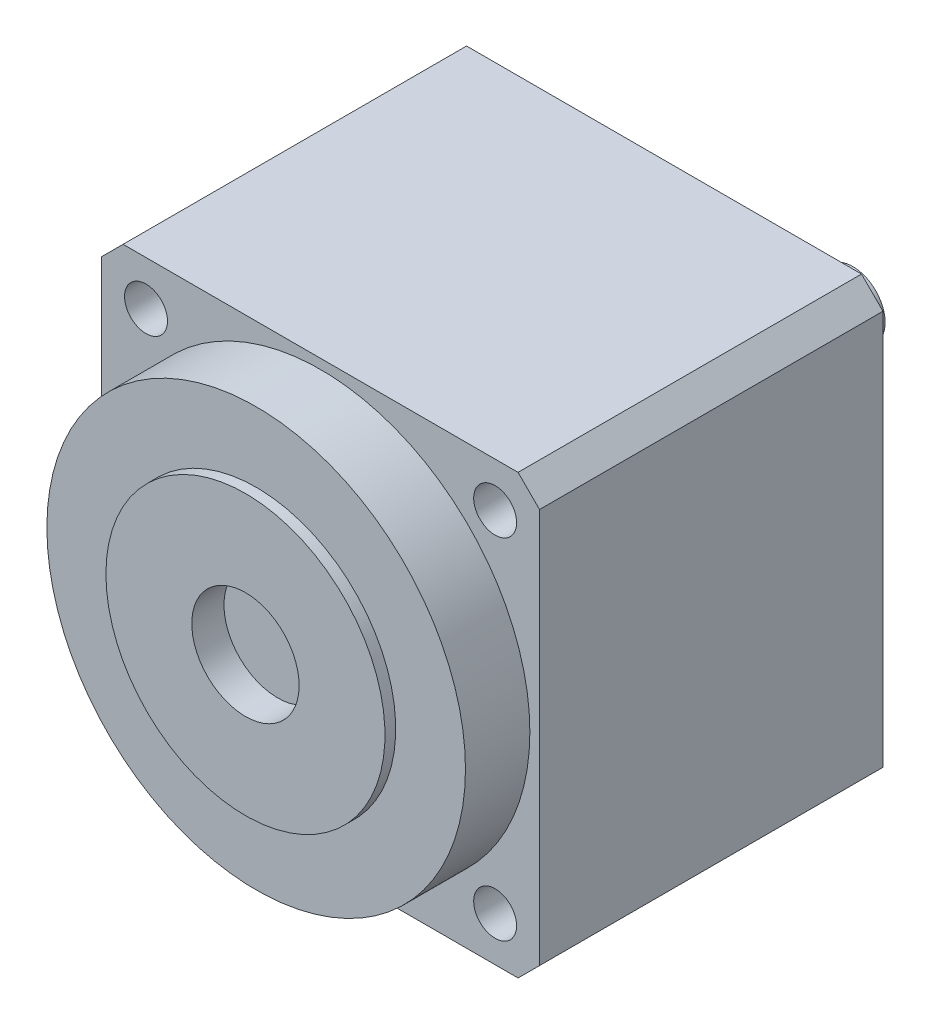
ISO-10303-21;
HEADER;
FILE_DESCRIPTION(('STEP AP214'),'2;1');
FILE_NAME('part.step','',(''),(''),'','','');
FILE_SCHEMA(('AUTOMOTIVE_DESIGN { 1 0 10303 214 1 1 1 1 }'));
ENDSEC;
DATA;
#1=APPLICATION_CONTEXT('core data for automotive mechanical design processes');
#2=APPLICATION_PROTOCOL_DEFINITION('international standard','automotive_design',2000,#1);
#3=PRODUCT_CONTEXT('',#1,'mechanical');
#4=PRODUCT('Part','Part','',(#3));
#5=PRODUCT_RELATED_PRODUCT_CATEGORY('part','',(#4));
#6=PRODUCT_DEFINITION_FORMATION('','',#4);
#7=PRODUCT_DEFINITION_CONTEXT('part definition',#1,'design');
#8=PRODUCT_DEFINITION('design','',#6,#7);
#9=PRODUCT_DEFINITION_SHAPE('','',#8);
#10=(LENGTH_UNIT() NAMED_UNIT(*) SI_UNIT(.MILLI.,.METRE.));
#11=(NAMED_UNIT(*) PLANE_ANGLE_UNIT() SI_UNIT($,.RADIAN.));
#12=(NAMED_UNIT(*) SI_UNIT($,.STERADIAN.) SOLID_ANGLE_UNIT());
#13=UNCERTAINTY_MEASURE_WITH_UNIT(LENGTH_MEASURE(1.E-05),#10,'distance_accuracy_value','');
#14=(GEOMETRIC_REPRESENTATION_CONTEXT(3) GLOBAL_UNCERTAINTY_ASSIGNED_CONTEXT((#13)) GLOBAL_UNIT_ASSIGNED_CONTEXT((#10,
#11,#12)) REPRESENTATION_CONTEXT('',''));
#15=CARTESIAN_POINT('',(0.,0.,0.));
#16=DIRECTION('',(0.,0.,1.));
#17=DIRECTION('',(1.,0.,0.));
#18=AXIS2_PLACEMENT_3D('',#15,#16,#17);
#19=CARTESIAN_POINT('',(10.2,-10.2,-0.799999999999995));
#20=DIRECTION('',(0.,0.,-0.999999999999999));
#21=DIRECTION('',(0.,1.,0.));
#22=AXIS2_PLACEMENT_3D('',#19,#20,#21);
#23=PLANE('',#22);
#24=CARTESIAN_POINT('',(10.2,-10.2,-0.799999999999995));
#25=DIRECTION('',(0.,0.,-0.999999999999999));
#26=DIRECTION('',(0.,1.,0.));
#27=AXIS2_PLACEMENT_3D('',#24,#25,#26);
#28=CIRCLE('',#27,4.5);
#29=CARTESIAN_POINT('',(10.2,-14.7,-0.799999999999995));
#30=VERTEX_POINT('',#29);
#31=EDGE_CURVE('E196',#30,#30,#28,.T.);
#32=ORIENTED_EDGE('',*,*,#31,.T.);
#33=EDGE_LOOP('',(#32));
#34=FACE_BOUND('',#33,.T.);
#35=CARTESIAN_POINT('',(10.2,-10.2,-0.799999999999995));
#36=DIRECTION('',(0.,0.,-0.999999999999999));
#37=DIRECTION('',(0.,1.,0.));
#38=AXIS2_PLACEMENT_3D('',#35,#36,#37);
#39=CIRCLE('',#38,1.5);
#40=CARTESIAN_POINT('',(10.2,-11.7,-0.799999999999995));
#41=VERTEX_POINT('',#40);
#42=EDGE_CURVE('E192',#41,#41,#39,.T.);
#43=ORIENTED_EDGE('',*,*,#42,.F.);
#44=EDGE_LOOP('',(#43));
#45=FACE_BOUND('',#44,.T.);
#46=ADVANCED_FACE('F43',(#34,#45),#23,.T.);
#47=CARTESIAN_POINT('',(0.,-20.4,0.));
#48=DIRECTION('',(0.,0.,0.999999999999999));
#49=DIRECTION('',(1.,0.,0.));
#50=AXIS2_PLACEMENT_3D('',#47,#48,#49);
#51=PLANE('',#50);
#52=DIRECTION('',(1.,0.,0.));
#53=VECTOR('',#52,1.);
#54=CARTESIAN_POINT('',(0.,-20.4,0.));
#55=LINE('',#54,#53);
#56=CARTESIAN_POINT('',(1.00000000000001,-20.4,0.));
#57=VERTEX_POINT('',#56);
#58=CARTESIAN_POINT('',(19.4,-20.4,0.));
#59=VERTEX_POINT('',#58);
#60=EDGE_CURVE('E243',#57,#59,#55,.T.);
#61=ORIENTED_EDGE('',*,*,#60,.F.);
#62=DIRECTION('',(0.707106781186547,-0.707106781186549,0.));
#63=VECTOR('',#62,1.);
#64=CARTESIAN_POINT('',(1.00000000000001,-20.4,0.));
#65=LINE('',#64,#63);
#66=CARTESIAN_POINT('',(0.,-19.4,0.));
#67=VERTEX_POINT('',#66);
#68=EDGE_CURVE('E265',#57,#67,#65,.F.);
#69=ORIENTED_EDGE('',*,*,#68,.T.);
#70=DIRECTION('',(0.,-1.,0.));
#71=VECTOR('',#70,1.);
#72=CARTESIAN_POINT('',(0.,0.,0.));
#73=LINE('',#72,#71);
#74=CARTESIAN_POINT('',(0.,-1.,0.));
#75=VERTEX_POINT('',#74);
#76=EDGE_CURVE('E222',#75,#67,#73,.T.);
#77=ORIENTED_EDGE('',*,*,#76,.F.);
#78=DIRECTION('',(-0.707106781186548,-0.707106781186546,0.));
#79=VECTOR('',#78,1.);
#80=CARTESIAN_POINT('',(0.,-1.,0.));
#81=LINE('',#80,#79);
#82=CARTESIAN_POINT('',(1.,0.,0.));
#83=VERTEX_POINT('',#82);
#84=EDGE_CURVE('E263',#75,#83,#81,.F.);
#85=ORIENTED_EDGE('',*,*,#84,.T.);
#86=DIRECTION('',(-1.,0.,0.));
#87=VECTOR('',#86,1.);
#88=CARTESIAN_POINT('',(0.,0.,0.));
#89=LINE('',#88,#87);
#90=CARTESIAN_POINT('',(19.4,0.,0.));
#91=VERTEX_POINT('',#90);
#92=EDGE_CURVE('E230',#91,#83,#89,.T.);
#93=ORIENTED_EDGE('',*,*,#92,.F.);
#94=DIRECTION('',(-0.707106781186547,0.707106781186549,0.));
#95=VECTOR('',#94,1.);
#96=CARTESIAN_POINT('',(19.4,0.,0.));
#97=LINE('',#96,#95);
#98=CARTESIAN_POINT('',(20.4,-1.00000000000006,0.));
#99=VERTEX_POINT('',#98);
#100=EDGE_CURVE('E261',#91,#99,#97,.F.);
#101=ORIENTED_EDGE('',*,*,#100,.T.);
#102=DIRECTION('',(0.,1.,0.));
#103=VECTOR('',#102,1.);
#104=CARTESIAN_POINT('',(20.4,0.,0.));
#105=LINE('',#104,#103);
#106=CARTESIAN_POINT('',(20.4,-19.4,0.));
#107=VERTEX_POINT('',#106);
#108=EDGE_CURVE('E246',#107,#99,#105,.T.);
#109=ORIENTED_EDGE('',*,*,#108,.F.);
#110=DIRECTION('',(0.707106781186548,0.707106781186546,0.));
#111=VECTOR('',#110,1.);
#112=CARTESIAN_POINT('',(20.4,-19.4,0.));
#113=LINE('',#112,#111);
#114=EDGE_CURVE('E259',#107,#59,#113,.F.);
#115=ORIENTED_EDGE('',*,*,#114,.T.);
#116=EDGE_LOOP('',(#61,#69,#77,#85,#93,#101,#109,#115));
#117=FACE_BOUND('',#116,.T.);
#118=CARTESIAN_POINT('',(10.2,-10.2,0.));
#119=DIRECTION('',(0.,0.,0.999999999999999));
#120=DIRECTION('',(1.,0.,0.));
#121=AXIS2_PLACEMENT_3D('',#118,#119,#120);
#122=CIRCLE('',#121,4.5);
#123=CARTESIAN_POINT('',(10.2,-14.7,0.));
#124=VERTEX_POINT('',#123);
#125=EDGE_CURVE('E240',#124,#124,#122,.F.);
#126=ORIENTED_EDGE('',*,*,#125,.F.);
#127=EDGE_LOOP('',(#126));
#128=FACE_BOUND('',#127,.T.);
#129=ADVANCED_FACE('F298',(#117,#128),#51,.F.);
#130=CARTESIAN_POINT('',(10.2,-10.2,19.));
#131=DIRECTION('',(0.,0.,0.999999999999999));
#132=DIRECTION('',(1.,0.,0.));
#133=AXIS2_PLACEMENT_3D('',#130,#131,#132);
#134=PLANE('',#133);
#135=CARTESIAN_POINT('',(10.2,-10.2,19.));
#136=DIRECTION('',(0.,0.,0.999999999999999));
#137=DIRECTION('',(1.,0.,0.));
#138=AXIS2_PLACEMENT_3D('',#135,#136,#137);
#139=CIRCLE('',#138,9.75);
#140=CARTESIAN_POINT('',(0.449999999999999,-10.2,19.));
#141=VERTEX_POINT('',#140);
#142=EDGE_CURVE('E218',#141,#141,#139,.T.);
#143=ORIENTED_EDGE('',*,*,#142,.T.);
#144=EDGE_LOOP('',(#143));
#145=FACE_BOUND('',#144,.T.);
#146=CARTESIAN_POINT('',(10.2,-10.2,19.));
#147=DIRECTION('',(0.,0.,0.999999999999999));
#148=DIRECTION('',(1.,0.,0.));
#149=AXIS2_PLACEMENT_3D('',#146,#147,#148);
#150=CIRCLE('',#149,6.5);
#151=CARTESIAN_POINT('',(3.7,-10.2,19.));
#152=VERTEX_POINT('',#151);
#153=EDGE_CURVE('E206',#152,#152,#150,.T.);
#154=ORIENTED_EDGE('',*,*,#153,.F.);
#155=EDGE_LOOP('',(#154));
#156=FACE_BOUND('',#155,.T.);
#157=ADVANCED_FACE('F333',(#145,#156),#134,.T.);
#158=CARTESIAN_POINT('',(0.,-20.4,16.));
#159=DIRECTION('',(0.,0.,0.999999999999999));
#160=DIRECTION('',(1.,0.,0.));
#161=AXIS2_PLACEMENT_3D('',#158,#159,#160);
#162=PLANE('',#161);
#163=CARTESIAN_POINT('',(18.3317279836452,-2.06827201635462,16.));
#164=DIRECTION('',(0.,0.,0.999999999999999));
#165=DIRECTION('',(0.,-1.,0.));
#166=AXIS2_PLACEMENT_3D('',#163,#164,#165);
#167=CIRCLE('',#166,0.999999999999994);
#168=CARTESIAN_POINT('',(18.3317279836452,-3.06827201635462,16.));
#169=VERTEX_POINT('',#168);
#170=EDGE_CURVE('E691',#169,#169,#167,.T.);
#171=ORIENTED_EDGE('',*,*,#170,.F.);
#172=EDGE_LOOP('',(#171));
#173=FACE_BOUND('',#172,.T.);
#174=CARTESIAN_POINT('',(18.3317279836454,-18.3317279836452,16.));
#175=DIRECTION('',(0.,0.,0.999999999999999));
#176=DIRECTION('',(-1.,0.,0.));
#177=AXIS2_PLACEMENT_3D('',#174,#175,#176);
#178=CIRCLE('',#177,0.999999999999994);
#179=CARTESIAN_POINT('',(17.3317279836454,-18.3317279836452,16.));
#180=VERTEX_POINT('',#179);
#181=EDGE_CURVE('E139',#180,#180,#178,.T.);
#182=ORIENTED_EDGE('',*,*,#181,.F.);
#183=EDGE_LOOP('',(#182));
#184=FACE_BOUND('',#183,.T.);
#185=CARTESIAN_POINT('',(2.06827201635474,-18.3317279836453,16.));
#186=DIRECTION('',(0.,0.,0.999999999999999));
#187=DIRECTION('',(0.,1.,0.));
#188=AXIS2_PLACEMENT_3D('',#185,#186,#187);
#189=CIRCLE('',#188,0.999999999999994);
#190=CARTESIAN_POINT('',(2.06827201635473,-17.3317279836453,16.));
#191=VERTEX_POINT('',#190);
#192=EDGE_CURVE('E164',#191,#191,#189,.T.);
#193=ORIENTED_EDGE('',*,*,#192,.F.);
#194=EDGE_LOOP('',(#193));
#195=FACE_BOUND('',#194,.T.);
#196=CARTESIAN_POINT('',(2.0682720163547,-2.06827201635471,16.));
#197=DIRECTION('',(0.,0.,0.999999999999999));
#198=DIRECTION('',(1.,0.,0.));
#199=AXIS2_PLACEMENT_3D('',#196,#197,#198);
#200=CIRCLE('',#199,0.999999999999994);
#201=CARTESIAN_POINT('',(3.06827201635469,-2.06827201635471,16.));
#202=VERTEX_POINT('',#201);
#203=EDGE_CURVE('E180',#202,#202,#200,.T.);
#204=ORIENTED_EDGE('',*,*,#203,.F.);
#205=EDGE_LOOP('',(#204));
#206=FACE_BOUND('',#205,.T.);
#207=DIRECTION('',(0.,-1.,0.));
#208=VECTOR('',#207,1.);
#209=CARTESIAN_POINT('',(0.,0.,16.));
#210=LINE('',#209,#208);
#211=CARTESIAN_POINT('',(0.,-1.,16.));
#212=VERTEX_POINT('',#211);
#213=CARTESIAN_POINT('',(0.,-19.4,16.));
#214=VERTEX_POINT('',#213);
#215=EDGE_CURVE('E226',#212,#214,#210,.T.);
#216=ORIENTED_EDGE('',*,*,#215,.T.);
#217=DIRECTION('',(-0.707106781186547,0.707106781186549,0.));
#218=VECTOR('',#217,1.);
#219=CARTESIAN_POINT('',(0.500000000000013,-19.9,16.));
#220=LINE('',#219,#218);
#221=CARTESIAN_POINT('',(1.00000000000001,-20.4,16.));
#222=VERTEX_POINT('',#221);
#223=EDGE_CURVE('E279',#214,#222,#220,.F.);
#224=ORIENTED_EDGE('',*,*,#223,.T.);
#225=DIRECTION('',(1.,0.,0.));
#226=VECTOR('',#225,1.);
#227=CARTESIAN_POINT('',(0.,-20.4,16.));
#228=LINE('',#227,#226);
#229=CARTESIAN_POINT('',(19.4,-20.4,16.));
#230=VERTEX_POINT('',#229);
#231=EDGE_CURVE('E229',#222,#230,#228,.T.);
#232=ORIENTED_EDGE('',*,*,#231,.T.);
#233=DIRECTION('',(-0.707106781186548,-0.707106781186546,0.));
#234=VECTOR('',#233,1.);
#235=CARTESIAN_POINT('',(9.69999999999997,-30.1,16.));
#236=LINE('',#235,#234);
#237=CARTESIAN_POINT('',(20.4,-19.4,16.));
#238=VERTEX_POINT('',#237);
#239=EDGE_CURVE('E272',#230,#238,#236,.F.);
#240=ORIENTED_EDGE('',*,*,#239,.T.);
#241=DIRECTION('',(0.,1.,0.));
#242=VECTOR('',#241,1.);
#243=CARTESIAN_POINT('',(20.4,0.,16.));
#244=LINE('',#243,#242);
#245=CARTESIAN_POINT('',(20.4,-1.00000000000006,16.));
#246=VERTEX_POINT('',#245);
#247=EDGE_CURVE('E234',#238,#246,#244,.T.);
#248=ORIENTED_EDGE('',*,*,#247,.T.);
#249=DIRECTION('',(0.707106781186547,-0.707106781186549,0.));
#250=VECTOR('',#249,1.);
#251=CARTESIAN_POINT('',(19.9,-0.500000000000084,16.));
#252=LINE('',#251,#250);
#253=CARTESIAN_POINT('',(19.4,0.,16.));
#254=VERTEX_POINT('',#253);
#255=EDGE_CURVE('E68',#246,#254,#252,.F.);
#256=ORIENTED_EDGE('',*,*,#255,.T.);
#257=DIRECTION('',(-1.,0.,0.));
#258=VECTOR('',#257,1.);
#259=CARTESIAN_POINT('',(0.,0.,16.));
#260=LINE('',#259,#258);
#261=CARTESIAN_POINT('',(0.999999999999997,0.,16.));
#262=VERTEX_POINT('',#261);
#263=EDGE_CURVE('E237',#254,#262,#260,.T.);
#264=ORIENTED_EDGE('',*,*,#263,.T.);
#265=DIRECTION('',(0.707106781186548,0.707106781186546,0.));
#266=VECTOR('',#265,1.);
#267=CARTESIAN_POINT('',(-9.7,-10.7,16.));
#268=LINE('',#267,#266);
#269=EDGE_CURVE('E277',#262,#212,#268,.F.);
#270=ORIENTED_EDGE('',*,*,#269,.T.);
#271=EDGE_LOOP('',(#216,#224,#232,#240,#248,#256,#264,#270));
#272=FACE_BOUND('',#271,.T.);
#273=CARTESIAN_POINT('',(10.2,-10.2,16.));
#274=DIRECTION('',(0.,0.,0.999999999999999));
#275=DIRECTION('',(1.,0.,0.));
#276=AXIS2_PLACEMENT_3D('',#273,#274,#275);
#277=CIRCLE('',#276,9.75);
#278=CARTESIAN_POINT('',(0.45,-10.2,16.));
#279=VERTEX_POINT('',#278);
#280=EDGE_CURVE('E214',#279,#279,#277,.T.);
#281=ORIENTED_EDGE('',*,*,#280,.F.);
#282=EDGE_LOOP('',(#281));
#283=FACE_BOUND('',#282,.T.);
#284=ADVANCED_FACE('F306',(#173,#184,#195,#206,#272,#283),#162,.T.);
#285=CARTESIAN_POINT('',(0.,0.,16.));
#286=DIRECTION('',(1.,0.,0.));
#287=DIRECTION('',(0.,1.,0.));
#288=AXIS2_PLACEMENT_3D('',#285,#286,#287);
#289=PLANE('',#288);
#290=ORIENTED_EDGE('',*,*,#76,.T.);
#291=DIRECTION('',(0.,0.,0.999999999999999));
#292=VECTOR('',#291,1.);
#293=CARTESIAN_POINT('',(0.,-19.4,16.));
#294=LINE('',#293,#292);
#295=EDGE_CURVE('E270',#67,#214,#294,.T.);
#296=ORIENTED_EDGE('',*,*,#295,.T.);
#297=ORIENTED_EDGE('',*,*,#215,.F.);
#298=DIRECTION('',(0.,0.,-0.999999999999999));
#299=VECTOR('',#298,1.);
#300=CARTESIAN_POINT('',(0.,-1.,16.));
#301=LINE('',#300,#299);
#302=EDGE_CURVE('E267',#212,#75,#301,.T.);
#303=ORIENTED_EDGE('',*,*,#302,.T.);
#304=EDGE_LOOP('',(#290,#296,#297,#303));
#305=FACE_BOUND('',#304,.T.);
#306=ADVANCED_FACE('F314',(#305),#289,.F.);
#307=CARTESIAN_POINT('',(0.,-20.4,16.));
#308=DIRECTION('',(0.,1.,0.));
#309=DIRECTION('',(0.,0.,0.999999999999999));
#310=AXIS2_PLACEMENT_3D('',#307,#308,#309);
#311=PLANE('',#310);
#312=ORIENTED_EDGE('',*,*,#231,.F.);
#313=DIRECTION('',(0.,0.,-0.999999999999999));
#314=VECTOR('',#313,1.);
#315=CARTESIAN_POINT('',(1.00000000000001,-20.4,16.));
#316=LINE('',#315,#314);
#317=EDGE_CURVE('E255',#222,#57,#316,.T.);
#318=ORIENTED_EDGE('',*,*,#317,.T.);
#319=ORIENTED_EDGE('',*,*,#60,.T.);
#320=DIRECTION('',(0.,0.,0.999999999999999));
#321=VECTOR('',#320,1.);
#322=CARTESIAN_POINT('',(19.4,-20.4,16.));
#323=LINE('',#322,#321);
#324=EDGE_CURVE('E252',#59,#230,#323,.T.);
#325=ORIENTED_EDGE('',*,*,#324,.T.);
#326=EDGE_LOOP('',(#312,#318,#319,#325));
#327=FACE_BOUND('',#326,.T.);
#328=ADVANCED_FACE('F321',(#327),#311,.F.);
#329=CARTESIAN_POINT('',(20.4,0.,16.));
#330=DIRECTION('',(-1.,0.,0.));
#331=DIRECTION('',(0.,-1.,0.));
#332=AXIS2_PLACEMENT_3D('',#329,#330,#331);
#333=PLANE('',#332);
#334=ORIENTED_EDGE('',*,*,#108,.T.);
#335=DIRECTION('',(0.,0.,0.999999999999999));
#336=VECTOR('',#335,1.);
#337=CARTESIAN_POINT('',(20.4,-1.00000000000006,16.));
#338=LINE('',#337,#336);
#339=EDGE_CURVE('E11',#99,#246,#338,.T.);
#340=ORIENTED_EDGE('',*,*,#339,.T.);
#341=ORIENTED_EDGE('',*,*,#247,.F.);
#342=DIRECTION('',(0.,0.,-0.999999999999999));
#343=VECTOR('',#342,1.);
#344=CARTESIAN_POINT('',(20.4,-19.4,16.));
#345=LINE('',#344,#343);
#346=EDGE_CURVE('E52',#238,#107,#345,.T.);
#347=ORIENTED_EDGE('',*,*,#346,.T.);
#348=EDGE_LOOP('',(#334,#340,#341,#347));
#349=FACE_BOUND('',#348,.T.);
#350=ADVANCED_FACE('F292',(#349),#333,.F.);
#351=CARTESIAN_POINT('',(0.,0.,16.));
#352=DIRECTION('',(0.,-1.,0.));
#353=DIRECTION('',(0.,0.,-0.999999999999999));
#354=AXIS2_PLACEMENT_3D('',#351,#352,#353);
#355=PLANE('',#354);
#356=ORIENTED_EDGE('',*,*,#92,.T.);
#357=DIRECTION('',(0.,0.,0.999999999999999));
#358=VECTOR('',#357,1.);
#359=CARTESIAN_POINT('',(1.,0.,16.));
#360=LINE('',#359,#358);
#361=EDGE_CURVE('E59',#83,#262,#360,.T.);
#362=ORIENTED_EDGE('',*,*,#361,.T.);
#363=ORIENTED_EDGE('',*,*,#263,.F.);
#364=DIRECTION('',(0.,0.,-0.999999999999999));
#365=VECTOR('',#364,1.);
#366=CARTESIAN_POINT('',(19.4,0.,16.));
#367=LINE('',#366,#365);
#368=EDGE_CURVE('E282',#254,#91,#367,.T.);
#369=ORIENTED_EDGE('',*,*,#368,.T.);
#370=EDGE_LOOP('',(#356,#362,#363,#369));
#371=FACE_BOUND('',#370,.T.);
#372=ADVANCED_FACE('F304',(#371),#355,.F.);
#373=CARTESIAN_POINT('',(10.2,-10.2,19.));
#374=DIRECTION('',(0.,0.,-0.999999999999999));
#375=DIRECTION('',(-1.,0.,0.));
#376=AXIS2_PLACEMENT_3D('',#373,#374,#375);
#377=CYLINDRICAL_SURFACE('',#376,9.75);
#378=CARTESIAN_POINT('',(0.449999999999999,-10.2,19.));
#379=CARTESIAN_POINT('',(0.449999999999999,-10.2,18.96875));
#380=CARTESIAN_POINT('',(0.449999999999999,-10.2,18.9375));
#381=CARTESIAN_POINT('',(0.449999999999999,-10.2,18.875));
#382=CARTESIAN_POINT('',(0.449999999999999,-10.2,18.84375));
#383=CARTESIAN_POINT('',(0.449999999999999,-10.2,18.78125));
#384=CARTESIAN_POINT('',(0.449999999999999,-10.2,18.75));
#385=CARTESIAN_POINT('',(0.449999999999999,-10.2,18.6875));
#386=CARTESIAN_POINT('',(0.449999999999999,-10.2,18.65625));
#387=CARTESIAN_POINT('',(0.449999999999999,-10.2,18.59375));
#388=CARTESIAN_POINT('',(0.449999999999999,-10.2,18.5625));
#389=CARTESIAN_POINT('',(0.449999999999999,-10.2,18.5));
#390=CARTESIAN_POINT('',(0.449999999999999,-10.2,18.46875));
#391=CARTESIAN_POINT('',(0.449999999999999,-10.2,18.40625));
#392=CARTESIAN_POINT('',(0.449999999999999,-10.2,18.375));
#393=CARTESIAN_POINT('',(0.449999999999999,-10.2,18.3125));
#394=CARTESIAN_POINT('',(0.449999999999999,-10.2,18.28125));
#395=CARTESIAN_POINT('',(0.449999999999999,-10.2,18.21875));
#396=CARTESIAN_POINT('',(0.449999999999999,-10.2,18.1875));
#397=CARTESIAN_POINT('',(0.449999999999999,-10.2,18.125));
#398=CARTESIAN_POINT('',(0.449999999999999,-10.2,18.09375));
#399=CARTESIAN_POINT('',(0.449999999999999,-10.2,18.03125));
#400=CARTESIAN_POINT('',(0.449999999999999,-10.2,18.));
#401=CARTESIAN_POINT('',(0.449999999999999,-10.2,17.9375));
#402=CARTESIAN_POINT('',(0.449999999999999,-10.2,17.90625));
#403=CARTESIAN_POINT('',(0.449999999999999,-10.2,17.84375));
#404=CARTESIAN_POINT('',(0.449999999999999,-10.2,17.8125));
#405=CARTESIAN_POINT('',(0.449999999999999,-10.2,17.75));
#406=CARTESIAN_POINT('',(0.449999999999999,-10.2,17.71875));
#407=CARTESIAN_POINT('',(0.449999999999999,-10.2,17.65625));
#408=CARTESIAN_POINT('',(0.449999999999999,-10.2,17.625));
#409=CARTESIAN_POINT('',(0.449999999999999,-10.2,17.5625));
#410=CARTESIAN_POINT('',(0.449999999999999,-10.2,17.53125));
#411=CARTESIAN_POINT('',(0.449999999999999,-10.2,17.46875));
#412=CARTESIAN_POINT('',(0.449999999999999,-10.2,17.4375));
#413=CARTESIAN_POINT('',(0.449999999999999,-10.2,17.375));
#414=CARTESIAN_POINT('',(0.449999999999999,-10.2,17.34375));
#415=CARTESIAN_POINT('',(0.449999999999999,-10.2,17.28125));
#416=CARTESIAN_POINT('',(0.449999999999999,-10.2,17.25));
#417=CARTESIAN_POINT('',(0.449999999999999,-10.2,17.1875));
#418=CARTESIAN_POINT('',(0.449999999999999,-10.2,17.15625));
#419=CARTESIAN_POINT('',(0.449999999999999,-10.2,17.09375));
#420=CARTESIAN_POINT('',(0.449999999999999,-10.2,17.0625));
#421=CARTESIAN_POINT('',(0.449999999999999,-10.2,17.));
#422=CARTESIAN_POINT('',(0.449999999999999,-10.2,16.96875));
#423=CARTESIAN_POINT('',(0.449999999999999,-10.2,16.90625));
#424=CARTESIAN_POINT('',(0.45,-10.2,16.875));
#425=CARTESIAN_POINT('',(0.45,-10.2,16.8125));
#426=CARTESIAN_POINT('',(0.45,-10.2,16.78125));
#427=CARTESIAN_POINT('',(0.45,-10.2,16.71875));
#428=CARTESIAN_POINT('',(0.45,-10.2,16.6875));
#429=CARTESIAN_POINT('',(0.45,-10.2,16.625));
#430=CARTESIAN_POINT('',(0.45,-10.2,16.59375));
#431=CARTESIAN_POINT('',(0.45,-10.2,16.53125));
#432=CARTESIAN_POINT('',(0.45,-10.2,16.5));
#433=CARTESIAN_POINT('',(0.45,-10.2,16.4375));
#434=CARTESIAN_POINT('',(0.45,-10.2,16.40625));
#435=CARTESIAN_POINT('',(0.45,-10.2,16.34375));
#436=CARTESIAN_POINT('',(0.45,-10.2,16.3125));
#437=CARTESIAN_POINT('',(0.45,-10.2,16.25));
#438=CARTESIAN_POINT('',(0.45,-10.2,16.21875));
#439=CARTESIAN_POINT('',(0.45,-10.2,16.15625));
#440=CARTESIAN_POINT('',(0.45,-10.2,16.125));
#441=CARTESIAN_POINT('',(0.45,-10.2,16.0625));
#442=CARTESIAN_POINT('',(0.45,-10.2,16.03125));
#443=CARTESIAN_POINT('',(0.45,-10.2,16.));
#444=B_SPLINE_CURVE_WITH_KNOTS('',3,(#378,#379,#380,#381,#382,#383,#384,#385,#386,#387,#388,
#389,#390,#391,#392,#393,#394,#395,#396,#397,#398,#399,#400,#401,#402,#403,#404,#405,#406,#407,
#408,#409,#410,#411,#412,#413,#414,#415,#416,#417,#418,#419,#420,#421,#422,#423,#424,#425,#426,
#427,#428,#429,#430,#431,#432,#433,#434,#435,#436,#437,#438,#439,#440,#441,#442,#443),
.UNSPECIFIED.,.F.,.F.,(4,2,2,2,2,2,2,2,2,2,2,2,2,2,2,2,2,2,2,2,2,2,2,2,2,2,2,2,2,2,2,2,4),(0.,
0.0937500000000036,0.1875,0.28125,0.375,0.468750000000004,0.5625,0.656250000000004,
0.750000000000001,0.843750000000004,0.937500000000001,1.03125,1.125,1.21875,1.3125,1.40625,1.5,
1.59375,1.6875,1.78125000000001,1.875,1.96875000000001,2.0625,2.15625000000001,2.25,
2.34375000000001,2.4375,2.53125000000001,2.625,2.71875,2.8125,2.90625000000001,3.),.UNSPECIFIED.);
#445=EDGE_CURVE('BSEAM359',#141,#279,#444,.T.);
#446=ORIENTED_EDGE('',*,*,#142,.F.);
#447=ORIENTED_EDGE('',*,*,#280,.T.);
#448=ORIENTED_EDGE('',*,*,#445,.T.);
#449=ORIENTED_EDGE('',*,*,#445,.F.);
#450=EDGE_LOOP('',(#446,#448,#447,#449));
#451=FACE_BOUND('',#450,.T.);
#452=ADVANCED_FACE('F359',(#451),#377,.T.);
#453=CARTESIAN_POINT('',(10.2,-10.2,19.5));
#454=DIRECTION('',(0.,0.,-0.999999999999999));
#455=DIRECTION('',(-1.,0.,0.));
#456=AXIS2_PLACEMENT_3D('',#453,#454,#455);
#457=CYLINDRICAL_SURFACE('',#456,6.5);
#458=CARTESIAN_POINT('',(10.2,-10.2,19.5));
#459=DIRECTION('',(0.,0.,0.999999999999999));
#460=DIRECTION('',(1.,0.,0.));
#461=AXIS2_PLACEMENT_3D('',#458,#459,#460);
#462=CIRCLE('',#461,6.5);
#463=CARTESIAN_POINT('',(3.7,-10.2,19.5));
#464=VERTEX_POINT('',#463);
#465=EDGE_CURVE('E210',#464,#464,#462,.T.);
#466=CARTESIAN_POINT('',(3.7,-10.2,19.5));
#467=CARTESIAN_POINT('',(3.7,-10.2,19.4947916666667));
#468=CARTESIAN_POINT('',(3.7,-10.2,19.4895833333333));
#469=CARTESIAN_POINT('',(3.7,-10.2,19.4791666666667));
#470=CARTESIAN_POINT('',(3.7,-10.2,19.4739583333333));
#471=CARTESIAN_POINT('',(3.7,-10.2,19.4635416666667));
#472=CARTESIAN_POINT('',(3.7,-10.2,19.4583333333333));
#473=CARTESIAN_POINT('',(3.7,-10.2,19.4479166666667));
#474=CARTESIAN_POINT('',(3.7,-10.2,19.4427083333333));
#475=CARTESIAN_POINT('',(3.7,-10.2,19.4322916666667));
#476=CARTESIAN_POINT('',(3.7,-10.2,19.4270833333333));
#477=CARTESIAN_POINT('',(3.7,-10.2,19.4166666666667));
#478=CARTESIAN_POINT('',(3.7,-10.2,19.4114583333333));
#479=CARTESIAN_POINT('',(3.7,-10.2,19.4010416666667));
#480=CARTESIAN_POINT('',(3.7,-10.2,19.3958333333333));
#481=CARTESIAN_POINT('',(3.7,-10.2,19.3854166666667));
#482=CARTESIAN_POINT('',(3.7,-10.2,19.3802083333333));
#483=CARTESIAN_POINT('',(3.7,-10.2,19.3697916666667));
#484=CARTESIAN_POINT('',(3.7,-10.2,19.3645833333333));
#485=CARTESIAN_POINT('',(3.7,-10.2,19.3541666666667));
#486=CARTESIAN_POINT('',(3.7,-10.2,19.3489583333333));
#487=CARTESIAN_POINT('',(3.7,-10.2,19.3385416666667));
#488=CARTESIAN_POINT('',(3.7,-10.2,19.3333333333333));
#489=CARTESIAN_POINT('',(3.7,-10.2,19.3229166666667));
#490=CARTESIAN_POINT('',(3.7,-10.2,19.3177083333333));
#491=CARTESIAN_POINT('',(3.7,-10.2,19.3072916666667));
#492=CARTESIAN_POINT('',(3.7,-10.2,19.3020833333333));
#493=CARTESIAN_POINT('',(3.7,-10.2,19.2916666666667));
#494=CARTESIAN_POINT('',(3.7,-10.2,19.2864583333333));
#495=CARTESIAN_POINT('',(3.7,-10.2,19.2760416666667));
#496=CARTESIAN_POINT('',(3.7,-10.2,19.2708333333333));
#497=CARTESIAN_POINT('',(3.7,-10.2,19.2604166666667));
#498=CARTESIAN_POINT('',(3.7,-10.2,19.2552083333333));
#499=CARTESIAN_POINT('',(3.7,-10.2,19.2447916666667));
#500=CARTESIAN_POINT('',(3.7,-10.2,19.2395833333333));
#501=CARTESIAN_POINT('',(3.7,-10.2,19.2291666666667));
#502=CARTESIAN_POINT('',(3.7,-10.2,19.2239583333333));
#503=CARTESIAN_POINT('',(3.7,-10.2,19.2135416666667));
#504=CARTESIAN_POINT('',(3.7,-10.2,19.2083333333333));
#505=CARTESIAN_POINT('',(3.7,-10.2,19.1979166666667));
#506=CARTESIAN_POINT('',(3.7,-10.2,19.1927083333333));
#507=CARTESIAN_POINT('',(3.7,-10.2,19.1822916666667));
#508=CARTESIAN_POINT('',(3.7,-10.2,19.1770833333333));
#509=CARTESIAN_POINT('',(3.7,-10.2,19.1666666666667));
#510=CARTESIAN_POINT('',(3.7,-10.2,19.1614583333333));
#511=CARTESIAN_POINT('',(3.7,-10.2,19.1510416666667));
#512=CARTESIAN_POINT('',(3.7,-10.2,19.1458333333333));
#513=CARTESIAN_POINT('',(3.7,-10.2,19.1354166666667));
#514=CARTESIAN_POINT('',(3.7,-10.2,19.1302083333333));
#515=CARTESIAN_POINT('',(3.7,-10.2,19.1197916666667));
#516=CARTESIAN_POINT('',(3.7,-10.2,19.1145833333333));
#517=CARTESIAN_POINT('',(3.7,-10.2,19.1041666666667));
#518=CARTESIAN_POINT('',(3.7,-10.2,19.0989583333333));
#519=CARTESIAN_POINT('',(3.7,-10.2,19.0885416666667));
#520=CARTESIAN_POINT('',(3.7,-10.2,19.0833333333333));
#521=CARTESIAN_POINT('',(3.7,-10.2,19.0729166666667));
#522=CARTESIAN_POINT('',(3.7,-10.2,19.0677083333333));
#523=CARTESIAN_POINT('',(3.7,-10.2,19.0572916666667));
#524=CARTESIAN_POINT('',(3.7,-10.2,19.0520833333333));
#525=CARTESIAN_POINT('',(3.7,-10.2,19.0416666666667));
#526=CARTESIAN_POINT('',(3.7,-10.2,19.0364583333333));
#527=CARTESIAN_POINT('',(3.7,-10.2,19.0260416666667));
#528=CARTESIAN_POINT('',(3.7,-10.2,19.0208333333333));
#529=CARTESIAN_POINT('',(3.7,-10.2,19.0104166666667));
#530=CARTESIAN_POINT('',(3.7,-10.2,19.0052083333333));
#531=CARTESIAN_POINT('',(3.7,-10.2,19.));
#532=B_SPLINE_CURVE_WITH_KNOTS('',3,(#466,#467,#468,#469,#470,#471,#472,#473,#474,#475,#476,
#477,#478,#479,#480,#481,#482,#483,#484,#485,#486,#487,#488,#489,#490,#491,#492,#493,#494,#495,
#496,#497,#498,#499,#500,#501,#502,#503,#504,#505,#506,#507,#508,#509,#510,#511,#512,#513,#514,
#515,#516,#517,#518,#519,#520,#521,#522,#523,#524,#525,#526,#527,#528,#529,#530,#531),
.UNSPECIFIED.,.F.,.F.,(4,2,2,2,2,2,2,2,2,2,2,2,2,2,2,2,2,2,2,2,2,2,2,2,2,2,2,2,2,2,2,2,4),(0.,
0.0156249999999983,0.03125,0.0468749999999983,0.0624999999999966,0.0781249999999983,
0.0937500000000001,0.109374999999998,0.124999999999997,0.140624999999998,0.15625,
0.171874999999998,0.187499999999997,0.203124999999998,0.21875,0.234374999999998,
0.249999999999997,0.265624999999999,0.281249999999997,0.296874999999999,0.312499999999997,
0.328124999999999,0.34375,0.359374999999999,0.374999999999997,0.390624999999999,
0.406249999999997,0.421874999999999,0.437499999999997,0.453124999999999,0.46875,
0.484374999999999,0.499999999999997),.UNSPECIFIED.);
#533=EDGE_CURVE('BSEAM355',#464,#152,#532,.T.);
#534=ORIENTED_EDGE('',*,*,#465,.F.);
#535=ORIENTED_EDGE('',*,*,#153,.T.);
#536=ORIENTED_EDGE('',*,*,#533,.T.);
#537=ORIENTED_EDGE('',*,*,#533,.F.);
#538=EDGE_LOOP('',(#534,#536,#535,#537));
#539=FACE_BOUND('',#538,.T.);
#540=ADVANCED_FACE('F355',(#539),#457,.T.);
#541=CARTESIAN_POINT('',(10.2,-10.2,19.5));
#542=DIRECTION('',(0.,0.,0.999999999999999));
#543=DIRECTION('',(1.,0.,0.));
#544=AXIS2_PLACEMENT_3D('',#541,#542,#543);
#545=PLANE('',#544);
#546=CARTESIAN_POINT('',(10.2,-10.2,19.5));
#547=DIRECTION('',(0.,0.,0.999999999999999));
#548=DIRECTION('',(1.,0.,0.));
#549=AXIS2_PLACEMENT_3D('',#546,#547,#548);
#550=CIRCLE('',#549,2.5);
#551=CARTESIAN_POINT('',(12.7,-10.2,19.5));
#552=VERTEX_POINT('',#551);
#553=EDGE_CURVE('E201',#552,#552,#550,.T.);
#554=ORIENTED_EDGE('',*,*,#553,.F.);
#555=EDGE_LOOP('',(#554));
#556=FACE_BOUND('',#555,.T.);
#557=ORIENTED_EDGE('',*,*,#465,.T.);
#558=EDGE_LOOP('',(#557));
#559=FACE_BOUND('',#558,.T.);
#560=ADVANCED_FACE('F351',(#556,#559),#545,.T.);
#561=CARTESIAN_POINT('',(10.2,-10.2,18.));
#562=DIRECTION('',(0.,0.,0.999999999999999));
#563=DIRECTION('',(1.,0.,0.));
#564=AXIS2_PLACEMENT_3D('',#561,#562,#563);
#565=CYLINDRICAL_SURFACE('',#564,2.5);
#566=CARTESIAN_POINT('',(10.2,-10.2,18.));
#567=DIRECTION('',(0.,0.,0.999999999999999));
#568=DIRECTION('',(1.,0.,0.));
#569=AXIS2_PLACEMENT_3D('',#566,#567,#568);
#570=CIRCLE('',#569,2.5);
#571=CARTESIAN_POINT('',(12.7,-10.2,18.));
#572=VERTEX_POINT('',#571);
#573=EDGE_CURVE('E202',#572,#572,#570,.T.);
#574=CARTESIAN_POINT('',(12.7,-10.2,18.));
#575=CARTESIAN_POINT('',(12.7,-10.2,18.015625));
#576=CARTESIAN_POINT('',(12.7,-10.2,18.03125));
#577=CARTESIAN_POINT('',(12.7,-10.2,18.0625));
#578=CARTESIAN_POINT('',(12.7,-10.2,18.078125));
#579=CARTESIAN_POINT('',(12.7,-10.2,18.109375));
#580=CARTESIAN_POINT('',(12.7,-10.2,18.125));
#581=CARTESIAN_POINT('',(12.7,-10.2,18.15625));
#582=CARTESIAN_POINT('',(12.7,-10.2,18.171875));
#583=CARTESIAN_POINT('',(12.7,-10.2,18.203125));
#584=CARTESIAN_POINT('',(12.7,-10.2,18.21875));
#585=CARTESIAN_POINT('',(12.7,-10.2,18.25));
#586=CARTESIAN_POINT('',(12.7,-10.2,18.265625));
#587=CARTESIAN_POINT('',(12.7,-10.2,18.296875));
#588=CARTESIAN_POINT('',(12.7,-10.2,18.3125));
#589=CARTESIAN_POINT('',(12.7,-10.2,18.34375));
#590=CARTESIAN_POINT('',(12.7,-10.2,18.359375));
#591=CARTESIAN_POINT('',(12.7,-10.2,18.390625));
#592=CARTESIAN_POINT('',(12.7,-10.2,18.40625));
#593=CARTESIAN_POINT('',(12.7,-10.2,18.4375));
#594=CARTESIAN_POINT('',(12.7,-10.2,18.453125));
#595=CARTESIAN_POINT('',(12.7,-10.2,18.484375));
#596=CARTESIAN_POINT('',(12.7,-10.2,18.5));
#597=CARTESIAN_POINT('',(12.7,-10.2,18.53125));
#598=CARTESIAN_POINT('',(12.7,-10.2,18.546875));
#599=CARTESIAN_POINT('',(12.7,-10.2,18.578125));
#600=CARTESIAN_POINT('',(12.7,-10.2,18.59375));
#601=CARTESIAN_POINT('',(12.7,-10.2,18.625));
#602=CARTESIAN_POINT('',(12.7,-10.2,18.640625));
#603=CARTESIAN_POINT('',(12.7,-10.2,18.671875));
#604=CARTESIAN_POINT('',(12.7,-10.2,18.6875));
#605=CARTESIAN_POINT('',(12.7,-10.2,18.71875));
#606=CARTESIAN_POINT('',(12.7,-10.2,18.734375));
#607=CARTESIAN_POINT('',(12.7,-10.2,18.765625));
#608=CARTESIAN_POINT('',(12.7,-10.2,18.78125));
#609=CARTESIAN_POINT('',(12.7,-10.2,18.8125));
#610=CARTESIAN_POINT('',(12.7,-10.2,18.828125));
#611=CARTESIAN_POINT('',(12.7,-10.2,18.859375));
#612=CARTESIAN_POINT('',(12.7,-10.2,18.875));
#613=CARTESIAN_POINT('',(12.7,-10.2,18.90625));
#614=CARTESIAN_POINT('',(12.7,-10.2,18.921875));
#615=CARTESIAN_POINT('',(12.7,-10.2,18.953125));
#616=CARTESIAN_POINT('',(12.7,-10.2,18.96875));
#617=CARTESIAN_POINT('',(12.7,-10.2,19.));
#618=CARTESIAN_POINT('',(12.7,-10.2,19.015625));
#619=CARTESIAN_POINT('',(12.7,-10.2,19.046875));
#620=CARTESIAN_POINT('',(12.7,-10.2,19.0625));
#621=CARTESIAN_POINT('',(12.7,-10.2,19.09375));
#622=CARTESIAN_POINT('',(12.7,-10.2,19.109375));
#623=CARTESIAN_POINT('',(12.7,-10.2,19.140625));
#624=CARTESIAN_POINT('',(12.7,-10.2,19.15625));
#625=CARTESIAN_POINT('',(12.7,-10.2,19.1875));
#626=CARTESIAN_POINT('',(12.7,-10.2,19.203125));
#627=CARTESIAN_POINT('',(12.7,-10.2,19.234375));
#628=CARTESIAN_POINT('',(12.7,-10.2,19.25));
#629=CARTESIAN_POINT('',(12.7,-10.2,19.28125));
#630=CARTESIAN_POINT('',(12.7,-10.2,19.296875));
#631=CARTESIAN_POINT('',(12.7,-10.2,19.328125));
#632=CARTESIAN_POINT('',(12.7,-10.2,19.34375));
#633=CARTESIAN_POINT('',(12.7,-10.2,19.375));
#634=CARTESIAN_POINT('',(12.7,-10.2,19.390625));
#635=CARTESIAN_POINT('',(12.7,-10.2,19.421875));
#636=CARTESIAN_POINT('',(12.7,-10.2,19.4375));
#637=CARTESIAN_POINT('',(12.7,-10.2,19.46875));
#638=CARTESIAN_POINT('',(12.7,-10.2,19.484375));
#639=CARTESIAN_POINT('',(12.7,-10.2,19.5));
#640=B_SPLINE_CURVE_WITH_KNOTS('',3,(#574,#575,#576,#577,#578,#579,#580,#581,#582,#583,#584,
#585,#586,#587,#588,#589,#590,#591,#592,#593,#594,#595,#596,#597,#598,#599,#600,#601,#602,#603,
#604,#605,#606,#607,#608,#609,#610,#611,#612,#613,#614,#615,#616,#617,#618,#619,#620,#621,#622,
#623,#624,#625,#626,#627,#628,#629,#630,#631,#632,#633,#634,#635,#636,#637,#638,#639),
.UNSPECIFIED.,.F.,.F.,(4,2,2,2,2,2,2,2,2,2,2,2,2,2,2,2,2,2,2,2,2,2,2,2,2,2,2,2,2,2,2,2,4),(0.,
0.0468749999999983,0.0937500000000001,0.140624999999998,0.187499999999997,0.234374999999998,
0.281249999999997,0.328124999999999,0.374999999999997,0.421874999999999,0.46875,
0.515624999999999,0.562499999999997,0.609374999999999,0.656250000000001,0.703124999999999,
0.749999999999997,0.796874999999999,0.843750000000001,0.890624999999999,0.937499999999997,
0.984374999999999,1.03125,1.078125,1.125,1.171875,1.21875,1.265625,1.3125,1.359375,1.40625,
1.453125,1.5),.UNSPECIFIED.);
#641=EDGE_CURVE('BSEAM347',#572,#552,#640,.T.);
#642=ORIENTED_EDGE('',*,*,#573,.F.);
#643=ORIENTED_EDGE('',*,*,#553,.T.);
#644=ORIENTED_EDGE('',*,*,#641,.T.);
#645=ORIENTED_EDGE('',*,*,#641,.F.);
#646=EDGE_LOOP('',(#642,#644,#643,#645));
#647=FACE_BOUND('',#646,.T.);
#648=ADVANCED_FACE('F347',(#647),#565,.F.);
#649=CARTESIAN_POINT('',(10.2,-10.2,18.));
#650=DIRECTION('',(0.,0.,0.999999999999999));
#651=DIRECTION('',(1.,0.,0.));
#652=AXIS2_PLACEMENT_3D('',#649,#650,#651);
#653=PLANE('',#652);
#654=ORIENTED_EDGE('',*,*,#573,.T.);
#655=EDGE_LOOP('',(#654));
#656=FACE_BOUND('',#655,.T.);
#657=ADVANCED_FACE('F343',(#656),#653,.T.);
#658=CARTESIAN_POINT('',(10.2,-10.2,-0.799999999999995));
#659=DIRECTION('',(0.,0.,0.999999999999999));
#660=DIRECTION('',(0.,-1.,0.));
#661=AXIS2_PLACEMENT_3D('',#658,#659,#660);
#662=CYLINDRICAL_SURFACE('',#661,4.5);
#663=CARTESIAN_POINT('',(10.2,-14.7,-0.799999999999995));
#664=CARTESIAN_POINT('',(10.2,-14.7,-0.791666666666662));
#665=CARTESIAN_POINT('',(10.2,-14.7,-0.783333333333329));
#666=CARTESIAN_POINT('',(10.2,-14.7,-0.766666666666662));
#667=CARTESIAN_POINT('',(10.2,-14.7,-0.758333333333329));
#668=CARTESIAN_POINT('',(10.2,-14.7,-0.741666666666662));
#669=CARTESIAN_POINT('',(10.2,-14.7,-0.733333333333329));
#670=CARTESIAN_POINT('',(10.2,-14.7,-0.716666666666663));
#671=CARTESIAN_POINT('',(10.2,-14.7,-0.708333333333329));
#672=CARTESIAN_POINT('',(10.2,-14.7,-0.691666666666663));
#673=CARTESIAN_POINT('',(10.2,-14.7,-0.68333333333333));
#674=CARTESIAN_POINT('',(10.2,-14.7,-0.666666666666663));
#675=CARTESIAN_POINT('',(10.2,-14.7,-0.65833333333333));
#676=CARTESIAN_POINT('',(10.2,-14.7,-0.641666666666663));
#677=CARTESIAN_POINT('',(10.2,-14.7,-0.63333333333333));
#678=CARTESIAN_POINT('',(10.2,-14.7,-0.616666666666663));
#679=CARTESIAN_POINT('',(10.2,-14.7,-0.60833333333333));
#680=CARTESIAN_POINT('',(10.2,-14.7,-0.591666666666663));
#681=CARTESIAN_POINT('',(10.2,-14.7,-0.58333333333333));
#682=CARTESIAN_POINT('',(10.2,-14.7,-0.566666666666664));
#683=CARTESIAN_POINT('',(10.2,-14.7,-0.55833333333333));
#684=CARTESIAN_POINT('',(10.2,-14.7,-0.541666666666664));
#685=CARTESIAN_POINT('',(10.2,-14.7,-0.533333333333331));
#686=CARTESIAN_POINT('',(10.2,-14.7,-0.516666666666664));
#687=CARTESIAN_POINT('',(10.2,-14.7,-0.508333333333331));
#688=CARTESIAN_POINT('',(10.2,-14.7,-0.491666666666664));
#689=CARTESIAN_POINT('',(10.2,-14.7,-0.483333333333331));
#690=CARTESIAN_POINT('',(10.2,-14.7,-0.466666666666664));
#691=CARTESIAN_POINT('',(10.2,-14.7,-0.458333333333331));
#692=CARTESIAN_POINT('',(10.2,-14.7,-0.441666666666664));
#693=CARTESIAN_POINT('',(10.2,-14.7,-0.433333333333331));
#694=CARTESIAN_POINT('',(10.2,-14.7,-0.416666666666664));
#695=CARTESIAN_POINT('',(10.2,-14.7,-0.408333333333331));
#696=CARTESIAN_POINT('',(10.2,-14.7,-0.391666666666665));
#697=CARTESIAN_POINT('',(10.2,-14.7,-0.383333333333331));
#698=CARTESIAN_POINT('',(10.2,-14.7,-0.366666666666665));
#699=CARTESIAN_POINT('',(10.2,-14.7,-0.358333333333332));
#700=CARTESIAN_POINT('',(10.2,-14.7,-0.341666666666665));
#701=CARTESIAN_POINT('',(10.2,-14.7,-0.333333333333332));
#702=CARTESIAN_POINT('',(10.2,-14.7,-0.316666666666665));
#703=CARTESIAN_POINT('',(10.2,-14.7,-0.308333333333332));
#704=CARTESIAN_POINT('',(10.2,-14.7,-0.291666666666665));
#705=CARTESIAN_POINT('',(10.2,-14.7,-0.283333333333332));
#706=CARTESIAN_POINT('',(10.2,-14.7,-0.266666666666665));
#707=CARTESIAN_POINT('',(10.2,-14.7,-0.258333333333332));
#708=CARTESIAN_POINT('',(10.2,-14.7,-0.241666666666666));
#709=CARTESIAN_POINT('',(10.2,-14.7,-0.233333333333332));
#710=CARTESIAN_POINT('',(10.2,-14.7,-0.216666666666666));
#711=CARTESIAN_POINT('',(10.2,-14.7,-0.208333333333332));
#712=CARTESIAN_POINT('',(10.2,-14.7,-0.191666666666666));
#713=CARTESIAN_POINT('',(10.2,-14.7,-0.183333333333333));
#714=CARTESIAN_POINT('',(10.2,-14.7,-0.166666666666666));
#715=CARTESIAN_POINT('',(10.2,-14.7,-0.158333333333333));
#716=CARTESIAN_POINT('',(10.2,-14.7,-0.141666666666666));
#717=CARTESIAN_POINT('',(10.2,-14.7,-0.133333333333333));
#718=CARTESIAN_POINT('',(10.2,-14.7,-0.116666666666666));
#719=CARTESIAN_POINT('',(10.2,-14.7,-0.108333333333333));
#720=CARTESIAN_POINT('',(10.2,-14.7,-0.0916666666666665));
#721=CARTESIAN_POINT('',(10.2,-14.7,-0.0833333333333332));
#722=CARTESIAN_POINT('',(10.2,-14.7,-0.0666666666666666));
#723=CARTESIAN_POINT('',(10.2,-14.7,-0.0583333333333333));
#724=CARTESIAN_POINT('',(10.2,-14.7,-0.0416666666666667));
#725=CARTESIAN_POINT('',(10.2,-14.7,-0.0333333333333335));
#726=CARTESIAN_POINT('',(10.2,-14.7,-0.0166666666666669));
#727=CARTESIAN_POINT('',(10.2,-14.7,-0.00833333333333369));
#728=CARTESIAN_POINT('',(10.2,-14.7,0.));
#729=B_SPLINE_CURVE_WITH_KNOTS('',3,(#663,#664,#665,#666,#667,#668,#669,#670,#671,#672,#673,
#674,#675,#676,#677,#678,#679,#680,#681,#682,#683,#684,#685,#686,#687,#688,#689,#690,#691,#692,
#693,#694,#695,#696,#697,#698,#699,#700,#701,#702,#703,#704,#705,#706,#707,#708,#709,#710,#711,
#712,#713,#714,#715,#716,#717,#718,#719,#720,#721,#722,#723,#724,#725,#726,#727,#728),
.UNSPECIFIED.,.F.,.F.,(4,2,2,2,2,2,2,2,2,2,2,2,2,2,2,2,2,2,2,2,2,2,2,2,2,2,2,2,2,2,2,2,4),(0.,
0.0249999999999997,0.0499999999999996,0.0749999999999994,0.0999999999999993,0.124999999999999,
0.149999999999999,0.174999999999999,0.199999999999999,0.224999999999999,0.249999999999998,
0.274999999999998,0.299999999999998,0.324999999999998,0.349999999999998,0.374999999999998,
0.399999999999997,0.424999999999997,0.449999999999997,0.474999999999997,0.499999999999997,
0.524999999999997,0.549999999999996,0.574999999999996,0.599999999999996,0.624999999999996,
0.649999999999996,0.674999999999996,0.699999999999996,0.724999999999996,0.749999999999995,
0.774999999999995,0.799999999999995),.UNSPECIFIED.);
#730=EDGE_CURVE('BSEAM340',#30,#124,#729,.T.);
#731=ORIENTED_EDGE('',*,*,#31,.F.);
#732=ORIENTED_EDGE('',*,*,#125,.T.);
#733=ORIENTED_EDGE('',*,*,#730,.T.);
#734=ORIENTED_EDGE('',*,*,#730,.F.);
#735=EDGE_LOOP('',(#731,#733,#732,#734));
#736=FACE_BOUND('',#735,.T.);
#737=ADVANCED_FACE('F340',(#736),#662,.T.);
#738=CARTESIAN_POINT('',(10.2,-10.2,-8.79999999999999));
#739=DIRECTION('',(0.,0.,0.999999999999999));
#740=DIRECTION('',(0.,-1.,0.));
#741=AXIS2_PLACEMENT_3D('',#738,#739,#740);
#742=CYLINDRICAL_SURFACE('',#741,1.5);
#743=CARTESIAN_POINT('',(10.2,-10.2,-8.79999999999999));
#744=DIRECTION('',(0.,0.,-0.999999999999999));
#745=DIRECTION('',(0.,1.,0.));
#746=AXIS2_PLACEMENT_3D('',#743,#744,#745);
#747=CIRCLE('',#746,1.5);
#748=CARTESIAN_POINT('',(10.2,-11.7,-8.79999999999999));
#749=VERTEX_POINT('',#748);
#750=EDGE_CURVE('E193',#749,#749,#747,.T.);
#751=CARTESIAN_POINT('',(10.2,-11.7,-8.79999999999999));
#752=CARTESIAN_POINT('',(10.2,-11.7,-8.71666666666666));
#753=CARTESIAN_POINT('',(10.2,-11.7,-8.63333333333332));
#754=CARTESIAN_POINT('',(10.2,-11.7,-8.46666666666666));
#755=CARTESIAN_POINT('',(10.2,-11.7,-8.38333333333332));
#756=CARTESIAN_POINT('',(10.2,-11.7,-8.21666666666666));
#757=CARTESIAN_POINT('',(10.2,-11.7,-8.13333333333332));
#758=CARTESIAN_POINT('',(10.2,-11.7,-7.96666666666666));
#759=CARTESIAN_POINT('',(10.2,-11.7,-7.88333333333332));
#760=CARTESIAN_POINT('',(10.2,-11.7,-7.71666666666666));
#761=CARTESIAN_POINT('',(10.2,-11.7,-7.63333333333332));
#762=CARTESIAN_POINT('',(10.2,-11.7,-7.46666666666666));
#763=CARTESIAN_POINT('',(10.2,-11.7,-7.38333333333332));
#764=CARTESIAN_POINT('',(10.2,-11.7,-7.21666666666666));
#765=CARTESIAN_POINT('',(10.2,-11.7,-7.13333333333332));
#766=CARTESIAN_POINT('',(10.2,-11.7,-6.96666666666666));
#767=CARTESIAN_POINT('',(10.2,-11.7,-6.88333333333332));
#768=CARTESIAN_POINT('',(10.2,-11.7,-6.71666666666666));
#769=CARTESIAN_POINT('',(10.2,-11.7,-6.63333333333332));
#770=CARTESIAN_POINT('',(10.2,-11.7,-6.46666666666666));
#771=CARTESIAN_POINT('',(10.2,-11.7,-6.38333333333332));
#772=CARTESIAN_POINT('',(10.2,-11.7,-6.21666666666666));
#773=CARTESIAN_POINT('',(10.2,-11.7,-6.13333333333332));
#774=CARTESIAN_POINT('',(10.2,-11.7,-5.96666666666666));
#775=CARTESIAN_POINT('',(10.2,-11.7,-5.88333333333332));
#776=CARTESIAN_POINT('',(10.2,-11.7,-5.71666666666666));
#777=CARTESIAN_POINT('',(10.2,-11.7,-5.63333333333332));
#778=CARTESIAN_POINT('',(10.2,-11.7,-5.46666666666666));
#779=CARTESIAN_POINT('',(10.2,-11.7,-5.38333333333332));
#780=CARTESIAN_POINT('',(10.2,-11.7,-5.21666666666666));
#781=CARTESIAN_POINT('',(10.2,-11.7,-5.13333333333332));
#782=CARTESIAN_POINT('',(10.2,-11.7,-4.96666666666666));
#783=CARTESIAN_POINT('',(10.2,-11.7,-4.88333333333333));
#784=CARTESIAN_POINT('',(10.2,-11.7,-4.71666666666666));
#785=CARTESIAN_POINT('',(10.2,-11.7,-4.63333333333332));
#786=CARTESIAN_POINT('',(10.2,-11.7,-4.46666666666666));
#787=CARTESIAN_POINT('',(10.2,-11.7,-4.38333333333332));
#788=CARTESIAN_POINT('',(10.2,-11.7,-4.21666666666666));
#789=CARTESIAN_POINT('',(10.2,-11.7,-4.13333333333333));
#790=CARTESIAN_POINT('',(10.2,-11.7,-3.96666666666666));
#791=CARTESIAN_POINT('',(10.2,-11.7,-3.88333333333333));
#792=CARTESIAN_POINT('',(10.2,-11.7,-3.71666666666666));
#793=CARTESIAN_POINT('',(10.2,-11.7,-3.63333333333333));
#794=CARTESIAN_POINT('',(10.2,-11.7,-3.46666666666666));
#795=CARTESIAN_POINT('',(10.2,-11.7,-3.38333333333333));
#796=CARTESIAN_POINT('',(10.2,-11.7,-3.21666666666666));
#797=CARTESIAN_POINT('',(10.2,-11.7,-3.13333333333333));
#798=CARTESIAN_POINT('',(10.2,-11.7,-2.96666666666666));
#799=CARTESIAN_POINT('',(10.2,-11.7,-2.88333333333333));
#800=CARTESIAN_POINT('',(10.2,-11.7,-2.71666666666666));
#801=CARTESIAN_POINT('',(10.2,-11.7,-2.63333333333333));
#802=CARTESIAN_POINT('',(10.2,-11.7,-2.46666666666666));
#803=CARTESIAN_POINT('',(10.2,-11.7,-2.38333333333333));
#804=CARTESIAN_POINT('',(10.2,-11.7,-2.21666666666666));
#805=CARTESIAN_POINT('',(10.2,-11.7,-2.13333333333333));
#806=CARTESIAN_POINT('',(10.2,-11.7,-1.96666666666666));
#807=CARTESIAN_POINT('',(10.2,-11.7,-1.88333333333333));
#808=CARTESIAN_POINT('',(10.2,-11.7,-1.71666666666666));
#809=CARTESIAN_POINT('',(10.2,-11.7,-1.63333333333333));
#810=CARTESIAN_POINT('',(10.2,-11.7,-1.46666666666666));
#811=CARTESIAN_POINT('',(10.2,-11.7,-1.38333333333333));
#812=CARTESIAN_POINT('',(10.2,-11.7,-1.21666666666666));
#813=CARTESIAN_POINT('',(10.2,-11.7,-1.13333333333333));
#814=CARTESIAN_POINT('',(10.2,-11.7,-0.966666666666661));
#815=CARTESIAN_POINT('',(10.2,-11.7,-0.883333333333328));
#816=CARTESIAN_POINT('',(10.2,-11.7,-0.799999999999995));
#817=B_SPLINE_CURVE_WITH_KNOTS('',3,(#751,#752,#753,#754,#755,#756,#757,#758,#759,#760,#761,
#762,#763,#764,#765,#766,#767,#768,#769,#770,#771,#772,#773,#774,#775,#776,#777,#778,#779,#780,
#781,#782,#783,#784,#785,#786,#787,#788,#789,#790,#791,#792,#793,#794,#795,#796,#797,#798,#799,
#800,#801,#802,#803,#804,#805,#806,#807,#808,#809,#810,#811,#812,#813,#814,#815,#816),
.UNSPECIFIED.,.F.,.F.,(4,2,2,2,2,2,2,2,2,2,2,2,2,2,2,2,2,2,2,2,2,2,2,2,2,2,2,2,2,2,2,2,4),(0.,
0.25,0.5,0.750000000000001,1.,1.25,1.5,1.75,2.,2.25,2.5,2.75,3.,3.25,3.5,3.75,4.,4.25,4.5,4.75,
5.,5.25,5.5,5.75,6.,6.25,6.5,6.75,7.,7.25,7.5,7.75,7.99999999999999),.UNSPECIFIED.);
#818=EDGE_CURVE('BSEAM338',#749,#41,#817,.T.);
#819=ORIENTED_EDGE('',*,*,#750,.F.);
#820=ORIENTED_EDGE('',*,*,#42,.T.);
#821=ORIENTED_EDGE('',*,*,#818,.T.);
#822=ORIENTED_EDGE('',*,*,#818,.F.);
#823=EDGE_LOOP('',(#819,#821,#820,#822));
#824=FACE_BOUND('',#823,.T.);
#825=ADVANCED_FACE('F338',(#824),#742,.T.);
#826=CARTESIAN_POINT('',(10.2,-10.2,-8.79999999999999));
#827=DIRECTION('',(0.,0.,-0.999999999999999));
#828=DIRECTION('',(0.,1.,0.));
#829=AXIS2_PLACEMENT_3D('',#826,#827,#828);
#830=PLANE('',#829);
#831=ORIENTED_EDGE('',*,*,#750,.T.);
#832=EDGE_LOOP('',(#831));
#833=FACE_BOUND('',#832,.T.);
#834=ADVANCED_FACE('F538',(#833),#830,.T.);
#835=CARTESIAN_POINT('',(2.0682720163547,-2.06827201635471,13.));
#836=DIRECTION('',(0.,0.,0.999999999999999));
#837=DIRECTION('',(1.,0.,0.));
#838=AXIS2_PLACEMENT_3D('',#835,#836,#837);
#839=CONICAL_SURFACE('',#838,0.799999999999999,1.02974425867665);
#840=CARTESIAN_POINT('',(2.0682720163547,-2.06827201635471,12.5193115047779));
#841=VERTEX_POINT('',#840);
#842=VERTEX_LOOP('',#841);
#843=FACE_BOUND('',#842,.T.);
#844=CARTESIAN_POINT('',(2.0682720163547,-2.06827201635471,13.));
#845=DIRECTION('',(0.,0.,0.999999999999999));
#846=DIRECTION('',(1.,0.,0.));
#847=AXIS2_PLACEMENT_3D('',#844,#845,#846);
#848=CIRCLE('',#847,0.799999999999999);
#849=CARTESIAN_POINT('',(2.8682720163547,-2.06827201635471,13.));
#850=VERTEX_POINT('',#849);
#851=EDGE_CURVE('E189',#850,#850,#848,.T.);
#852=ORIENTED_EDGE('',*,*,#851,.T.);
#853=EDGE_LOOP('',(#852));
#854=FACE_BOUND('',#853,.T.);
#855=ADVANCED_FACE('F529',(#843,#854),#839,.F.);
#856=CARTESIAN_POINT('',(2.0682720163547,-2.06827201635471,16.));
#857=DIRECTION('',(0.,0.,0.999999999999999));
#858=DIRECTION('',(1.,0.,0.));
#859=AXIS2_PLACEMENT_3D('',#856,#857,#858);
#860=CYLINDRICAL_SURFACE('',#859,0.799999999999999);
#861=CARTESIAN_POINT('',(2.0682720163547,-2.06827201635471,13.2));
#862=DIRECTION('',(0.,0.,0.999999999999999));
#863=DIRECTION('',(1.,0.,0.));
#864=AXIS2_PLACEMENT_3D('',#861,#862,#863);
#865=CIRCLE('',#864,0.799999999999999);
#866=CARTESIAN_POINT('',(2.8682720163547,-2.06827201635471,13.2));
#867=VERTEX_POINT('',#866);
#868=EDGE_CURVE('E186',#867,#867,#865,.T.);
#869=CARTESIAN_POINT('',(2.8682720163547,-2.06827201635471,13.));
#870=CARTESIAN_POINT('',(2.8682720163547,-2.06827201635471,13.0020833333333));
#871=CARTESIAN_POINT('',(2.8682720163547,-2.06827201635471,13.0041666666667));
#872=CARTESIAN_POINT('',(2.8682720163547,-2.06827201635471,13.0083333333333));
#873=CARTESIAN_POINT('',(2.8682720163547,-2.06827201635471,13.0104166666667));
#874=CARTESIAN_POINT('',(2.8682720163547,-2.06827201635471,13.0145833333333));
#875=CARTESIAN_POINT('',(2.8682720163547,-2.06827201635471,13.0166666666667));
#876=CARTESIAN_POINT('',(2.8682720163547,-2.06827201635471,13.0208333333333));
#877=CARTESIAN_POINT('',(2.8682720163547,-2.06827201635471,13.0229166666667));
#878=CARTESIAN_POINT('',(2.8682720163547,-2.06827201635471,13.0270833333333));
#879=CARTESIAN_POINT('',(2.8682720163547,-2.06827201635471,13.0291666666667));
#880=CARTESIAN_POINT('',(2.8682720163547,-2.06827201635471,13.0333333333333));
#881=CARTESIAN_POINT('',(2.8682720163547,-2.06827201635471,13.0354166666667));
#882=CARTESIAN_POINT('',(2.8682720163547,-2.06827201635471,13.0395833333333));
#883=CARTESIAN_POINT('',(2.8682720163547,-2.06827201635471,13.0416666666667));
#884=CARTESIAN_POINT('',(2.8682720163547,-2.06827201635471,13.0458333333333));
#885=CARTESIAN_POINT('',(2.8682720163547,-2.06827201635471,13.0479166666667));
#886=CARTESIAN_POINT('',(2.8682720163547,-2.06827201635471,13.0520833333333));
#887=CARTESIAN_POINT('',(2.8682720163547,-2.06827201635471,13.0541666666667));
#888=CARTESIAN_POINT('',(2.8682720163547,-2.06827201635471,13.0583333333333));
#889=CARTESIAN_POINT('',(2.8682720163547,-2.06827201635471,13.0604166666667));
#890=CARTESIAN_POINT('',(2.8682720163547,-2.06827201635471,13.0645833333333));
#891=CARTESIAN_POINT('',(2.8682720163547,-2.06827201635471,13.0666666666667));
#892=CARTESIAN_POINT('',(2.8682720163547,-2.06827201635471,13.0708333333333));
#893=CARTESIAN_POINT('',(2.8682720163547,-2.06827201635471,13.0729166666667));
#894=CARTESIAN_POINT('',(2.8682720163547,-2.06827201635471,13.0770833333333));
#895=CARTESIAN_POINT('',(2.8682720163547,-2.06827201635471,13.0791666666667));
#896=CARTESIAN_POINT('',(2.8682720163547,-2.06827201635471,13.0833333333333));
#897=CARTESIAN_POINT('',(2.8682720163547,-2.06827201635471,13.0854166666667));
#898=CARTESIAN_POINT('',(2.8682720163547,-2.06827201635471,13.0895833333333));
#899=CARTESIAN_POINT('',(2.8682720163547,-2.06827201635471,13.0916666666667));
#900=CARTESIAN_POINT('',(2.8682720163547,-2.06827201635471,13.0958333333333));
#901=CARTESIAN_POINT('',(2.8682720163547,-2.06827201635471,13.0979166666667));
#902=CARTESIAN_POINT('',(2.8682720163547,-2.06827201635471,13.1020833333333));
#903=CARTESIAN_POINT('',(2.8682720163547,-2.06827201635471,13.1041666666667));
#904=CARTESIAN_POINT('',(2.8682720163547,-2.06827201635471,13.1083333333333));
#905=CARTESIAN_POINT('',(2.8682720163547,-2.06827201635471,13.1104166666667));
#906=CARTESIAN_POINT('',(2.8682720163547,-2.06827201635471,13.1145833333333));
#907=CARTESIAN_POINT('',(2.8682720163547,-2.06827201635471,13.1166666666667));
#908=CARTESIAN_POINT('',(2.8682720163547,-2.06827201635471,13.1208333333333));
#909=CARTESIAN_POINT('',(2.8682720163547,-2.06827201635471,13.1229166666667));
#910=CARTESIAN_POINT('',(2.8682720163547,-2.06827201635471,13.1270833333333));
#911=CARTESIAN_POINT('',(2.8682720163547,-2.06827201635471,13.1291666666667));
#912=CARTESIAN_POINT('',(2.8682720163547,-2.06827201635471,13.1333333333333));
#913=CARTESIAN_POINT('',(2.8682720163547,-2.06827201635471,13.1354166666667));
#914=CARTESIAN_POINT('',(2.8682720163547,-2.06827201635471,13.1395833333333));
#915=CARTESIAN_POINT('',(2.8682720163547,-2.06827201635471,13.1416666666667));
#916=CARTESIAN_POINT('',(2.8682720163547,-2.06827201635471,13.1458333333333));
#917=CARTESIAN_POINT('',(2.8682720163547,-2.06827201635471,13.1479166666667));
#918=CARTESIAN_POINT('',(2.8682720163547,-2.06827201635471,13.1520833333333));
#919=CARTESIAN_POINT('',(2.8682720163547,-2.06827201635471,13.1541666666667));
#920=CARTESIAN_POINT('',(2.8682720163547,-2.06827201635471,13.1583333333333));
#921=CARTESIAN_POINT('',(2.8682720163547,-2.06827201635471,13.1604166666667));
#922=CARTESIAN_POINT('',(2.8682720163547,-2.06827201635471,13.1645833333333));
#923=CARTESIAN_POINT('',(2.8682720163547,-2.06827201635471,13.1666666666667));
#924=CARTESIAN_POINT('',(2.8682720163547,-2.06827201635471,13.1708333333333));
#925=CARTESIAN_POINT('',(2.8682720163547,-2.06827201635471,13.1729166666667));
#926=CARTESIAN_POINT('',(2.8682720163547,-2.06827201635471,13.1770833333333));
#927=CARTESIAN_POINT('',(2.8682720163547,-2.06827201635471,13.1791666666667));
#928=CARTESIAN_POINT('',(2.8682720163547,-2.06827201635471,13.1833333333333));
#929=CARTESIAN_POINT('',(2.8682720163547,-2.06827201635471,13.1854166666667));
#930=CARTESIAN_POINT('',(2.8682720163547,-2.06827201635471,13.1895833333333));
#931=CARTESIAN_POINT('',(2.8682720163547,-2.06827201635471,13.1916666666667));
#932=CARTESIAN_POINT('',(2.8682720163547,-2.06827201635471,13.1958333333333));
#933=CARTESIAN_POINT('',(2.8682720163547,-2.06827201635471,13.1979166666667));
#934=CARTESIAN_POINT('',(2.8682720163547,-2.06827201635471,13.2));
#935=B_SPLINE_CURVE_WITH_KNOTS('',3,(#869,#870,#871,#872,#873,#874,#875,#876,#877,#878,#879,
#880,#881,#882,#883,#884,#885,#886,#887,#888,#889,#890,#891,#892,#893,#894,#895,#896,#897,#898,
#899,#900,#901,#902,#903,#904,#905,#906,#907,#908,#909,#910,#911,#912,#913,#914,#915,#916,#917,
#918,#919,#920,#921,#922,#923,#924,#925,#926,#927,#928,#929,#930,#931,#932,#933,#934),
.UNSPECIFIED.,.F.,.F.,(4,2,2,2,2,2,2,2,2,2,2,2,2,2,2,2,2,2,2,2,2,2,2,2,2,2,2,2,2,2,2,2,4),(0.,
0.00625000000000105,0.0125000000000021,0.0187500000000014,0.0250000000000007,0.0312500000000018,
0.0375000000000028,0.0437500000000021,0.0500000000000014,0.0562500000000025,0.0625000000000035,
0.0687500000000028,0.0750000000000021,0.0812500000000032,0.0875000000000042,0.0937500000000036,
0.100000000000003,0.106250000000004,0.112500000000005,0.118750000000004,0.125000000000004,
0.131250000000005,0.137500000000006,0.143750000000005,0.150000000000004,0.156250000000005,
0.162500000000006,0.168750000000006,0.175000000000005,0.181250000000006,0.187500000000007,
0.193750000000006,0.200000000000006),.UNSPECIFIED.);
#936=EDGE_CURVE('BSEAM520',#850,#867,#935,.T.);
#937=ORIENTED_EDGE('',*,*,#851,.F.);
#938=ORIENTED_EDGE('',*,*,#868,.T.);
#939=ORIENTED_EDGE('',*,*,#936,.T.);
#940=ORIENTED_EDGE('',*,*,#936,.F.);
#941=EDGE_LOOP('',(#937,#939,#938,#940));
#942=FACE_BOUND('',#941,.T.);
#943=ADVANCED_FACE('F520',(#942),#860,.F.);
#944=CARTESIAN_POINT('',(2.8682720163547,-2.06827201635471,13.2));
#945=DIRECTION('',(0.,0.,-0.999999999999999));
#946=DIRECTION('',(-1.,0.,0.));
#947=AXIS2_PLACEMENT_3D('',#944,#945,#946);
#948=PLANE('',#947);
#949=ORIENTED_EDGE('',*,*,#868,.F.);
#950=EDGE_LOOP('',(#949));
#951=FACE_BOUND('',#950,.T.);
#952=CARTESIAN_POINT('',(2.0682720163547,-2.06827201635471,13.2));
#953=DIRECTION('',(0.,0.,0.999999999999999));
#954=DIRECTION('',(1.,0.,0.));
#955=AXIS2_PLACEMENT_3D('',#952,#953,#954);
#956=CIRCLE('',#955,0.999999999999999);
#957=CARTESIAN_POINT('',(3.06827201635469,-2.06827201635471,13.2));
#958=VERTEX_POINT('',#957);
#959=EDGE_CURVE('E183',#958,#958,#956,.T.);
#960=ORIENTED_EDGE('',*,*,#959,.T.);
#961=EDGE_LOOP('',(#960));
#962=FACE_BOUND('',#961,.T.);
#963=ADVANCED_FACE('F511',(#951,#962),#948,.F.);
#964=CARTESIAN_POINT('',(2.0682720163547,-2.06827201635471,16.));
#965=DIRECTION('',(0.,0.,0.999999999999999));
#966=DIRECTION('',(1.,0.,0.));
#967=AXIS2_PLACEMENT_3D('',#964,#965,#966);
#968=CYLINDRICAL_SURFACE('',#967,0.999999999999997);
#969=CARTESIAN_POINT('',(3.06827201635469,-2.06827201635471,13.2));
#970=CARTESIAN_POINT('',(3.06827201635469,-2.06827201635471,13.2291666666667));
#971=CARTESIAN_POINT('',(3.06827201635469,-2.06827201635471,13.2583333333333));
#972=CARTESIAN_POINT('',(3.06827201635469,-2.06827201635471,13.3166666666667));
#973=CARTESIAN_POINT('',(3.06827201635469,-2.06827201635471,13.3458333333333));
#974=CARTESIAN_POINT('',(3.06827201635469,-2.06827201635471,13.4041666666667));
#975=CARTESIAN_POINT('',(3.06827201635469,-2.06827201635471,13.4333333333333));
#976=CARTESIAN_POINT('',(3.06827201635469,-2.06827201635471,13.4916666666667));
#977=CARTESIAN_POINT('',(3.06827201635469,-2.06827201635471,13.5208333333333));
#978=CARTESIAN_POINT('',(3.06827201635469,-2.06827201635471,13.5791666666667));
#979=CARTESIAN_POINT('',(3.06827201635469,-2.06827201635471,13.6083333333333));
#980=CARTESIAN_POINT('',(3.06827201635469,-2.06827201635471,13.6666666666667));
#981=CARTESIAN_POINT('',(3.06827201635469,-2.06827201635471,13.6958333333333));
#982=CARTESIAN_POINT('',(3.06827201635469,-2.06827201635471,13.7541666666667));
#983=CARTESIAN_POINT('',(3.06827201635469,-2.06827201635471,13.7833333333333));
#984=CARTESIAN_POINT('',(3.06827201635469,-2.06827201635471,13.8416666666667));
#985=CARTESIAN_POINT('',(3.06827201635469,-2.06827201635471,13.8708333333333));
#986=CARTESIAN_POINT('',(3.06827201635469,-2.06827201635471,13.9291666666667));
#987=CARTESIAN_POINT('',(3.06827201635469,-2.06827201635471,13.9583333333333));
#988=CARTESIAN_POINT('',(3.06827201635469,-2.06827201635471,14.0166666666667));
#989=CARTESIAN_POINT('',(3.06827201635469,-2.06827201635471,14.0458333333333));
#990=CARTESIAN_POINT('',(3.06827201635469,-2.06827201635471,14.1041666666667));
#991=CARTESIAN_POINT('',(3.06827201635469,-2.06827201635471,14.1333333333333));
#992=CARTESIAN_POINT('',(3.06827201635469,-2.06827201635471,14.1916666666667));
#993=CARTESIAN_POINT('',(3.06827201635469,-2.06827201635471,14.2208333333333));
#994=CARTESIAN_POINT('',(3.06827201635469,-2.06827201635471,14.2791666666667));
#995=CARTESIAN_POINT('',(3.06827201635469,-2.06827201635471,14.3083333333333));
#996=CARTESIAN_POINT('',(3.06827201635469,-2.06827201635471,14.3666666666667));
#997=CARTESIAN_POINT('',(3.06827201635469,-2.06827201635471,14.3958333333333));
#998=CARTESIAN_POINT('',(3.06827201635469,-2.06827201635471,14.4541666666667));
#999=CARTESIAN_POINT('',(3.06827201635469,-2.06827201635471,14.4833333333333));
#1000=CARTESIAN_POINT('',(3.06827201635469,-2.06827201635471,14.5416666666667));
#1001=CARTESIAN_POINT('',(3.06827201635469,-2.06827201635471,14.5708333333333));
#1002=CARTESIAN_POINT('',(3.06827201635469,-2.06827201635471,14.6291666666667));
#1003=CARTESIAN_POINT('',(3.06827201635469,-2.06827201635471,14.6583333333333));
#1004=CARTESIAN_POINT('',(3.06827201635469,-2.06827201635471,14.7166666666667));
#1005=CARTESIAN_POINT('',(3.06827201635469,-2.06827201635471,14.7458333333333));
#1006=CARTESIAN_POINT('',(3.06827201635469,-2.06827201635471,14.8041666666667));
#1007=CARTESIAN_POINT('',(3.06827201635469,-2.06827201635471,14.8333333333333));
#1008=CARTESIAN_POINT('',(3.06827201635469,-2.06827201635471,14.8916666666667));
#1009=CARTESIAN_POINT('',(3.06827201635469,-2.06827201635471,14.9208333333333));
#1010=CARTESIAN_POINT('',(3.06827201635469,-2.06827201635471,14.9791666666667));
#1011=CARTESIAN_POINT('',(3.06827201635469,-2.06827201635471,15.0083333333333));
#1012=CARTESIAN_POINT('',(3.06827201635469,-2.06827201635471,15.0666666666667));
#1013=CARTESIAN_POINT('',(3.06827201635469,-2.06827201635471,15.0958333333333));
#1014=CARTESIAN_POINT('',(3.06827201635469,-2.06827201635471,15.1541666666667));
#1015=CARTESIAN_POINT('',(3.06827201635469,-2.06827201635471,15.1833333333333));
#1016=CARTESIAN_POINT('',(3.06827201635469,-2.06827201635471,15.2416666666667));
#1017=CARTESIAN_POINT('',(3.06827201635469,-2.06827201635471,15.2708333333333));
#1018=CARTESIAN_POINT('',(3.06827201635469,-2.06827201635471,15.3291666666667));
#1019=CARTESIAN_POINT('',(3.06827201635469,-2.06827201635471,15.3583333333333));
#1020=CARTESIAN_POINT('',(3.06827201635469,-2.06827201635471,15.4166666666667));
#1021=CARTESIAN_POINT('',(3.06827201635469,-2.06827201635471,15.4458333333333));
#1022=CARTESIAN_POINT('',(3.06827201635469,-2.06827201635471,15.5041666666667));
#1023=CARTESIAN_POINT('',(3.06827201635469,-2.06827201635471,15.5333333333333));
#1024=CARTESIAN_POINT('',(3.06827201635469,-2.06827201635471,15.5916666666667));
#1025=CARTESIAN_POINT('',(3.06827201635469,-2.06827201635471,15.6208333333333));
#1026=CARTESIAN_POINT('',(3.06827201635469,-2.06827201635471,15.6791666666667));
#1027=CARTESIAN_POINT('',(3.06827201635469,-2.06827201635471,15.7083333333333));
#1028=CARTESIAN_POINT('',(3.06827201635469,-2.06827201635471,15.7666666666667));
#1029=CARTESIAN_POINT('',(3.06827201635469,-2.06827201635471,15.7958333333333));
#1030=CARTESIAN_POINT('',(3.06827201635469,-2.06827201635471,15.8541666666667));
#1031=CARTESIAN_POINT('',(3.06827201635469,-2.06827201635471,15.8833333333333));
#1032=CARTESIAN_POINT('',(3.06827201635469,-2.06827201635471,15.9416666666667));
#1033=CARTESIAN_POINT('',(3.06827201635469,-2.06827201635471,15.9708333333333));
#1034=CARTESIAN_POINT('',(3.06827201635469,-2.06827201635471,16.));
#1035=B_SPLINE_CURVE_WITH_KNOTS('',3,(#969,#970,#971,#972,#973,#974,#975,#976,#977,#978,#979,
#980,#981,#982,#983,#984,#985,#986,#987,#988,#989,#990,#991,#992,#993,#994,#995,#996,#997,#998,
#999,#1000,#1001,#1002,#1003,#1004,#1005,#1006,#1007,#1008,#1009,#1010,#1011,#1012,#1013,#1014,
#1015,#1016,#1017,#1018,#1019,#1020,#1021,#1022,#1023,#1024,#1025,#1026,#1027,#1028,#1029,#1030,
#1031,#1032,#1033,#1034),.UNSPECIFIED.,.F.,.F.,(4,2,2,2,2,2,2,2,2,2,2,2,2,2,2,2,2,2,2,2,2,2,2,2,
2,2,2,2,2,2,2,2,4),(0.,0.0875000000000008,0.175,0.262500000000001,0.35,0.4375,0.525000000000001,
0.6125,0.699999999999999,0.7875,0.875000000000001,0.9625,1.05,1.1375,1.225,1.3125,1.4,1.4875,
1.575,1.6625,1.75,1.8375,1.925,2.0125,2.1,2.1875,2.275,2.3625,2.45,2.5375,2.625,2.7125,2.8),.UNSPECIFIED.);
#1036=EDGE_CURVE('BSEAM479',#958,#202,#1035,.T.);
#1037=ORIENTED_EDGE('',*,*,#959,.F.);
#1038=ORIENTED_EDGE('',*,*,#203,.T.);
#1039=ORIENTED_EDGE('',*,*,#1036,.T.);
#1040=ORIENTED_EDGE('',*,*,#1036,.F.);
#1041=EDGE_LOOP('',(#1037,#1039,#1038,#1040));
#1042=FACE_BOUND('',#1041,.T.);
#1043=ADVANCED_FACE('F479',(#1042),#968,.F.);
#1044=CARTESIAN_POINT('',(2.06827201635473,-18.3317279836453,13.));
#1045=DIRECTION('',(0.,0.,0.999999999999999));
#1046=DIRECTION('',(0.,1.,0.));
#1047=AXIS2_PLACEMENT_3D('',#1044,#1045,#1046);
#1048=CONICAL_SURFACE('',#1047,0.799999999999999,1.02974425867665);
#1049=CARTESIAN_POINT('',(2.06827201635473,-18.3317279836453,12.5193115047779));
#1050=VERTEX_POINT('',#1049);
#1051=VERTEX_LOOP('',#1050);
#1052=FACE_BOUND('',#1051,.T.);
#1053=CARTESIAN_POINT('',(2.06827201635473,-18.3317279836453,13.));
#1054=DIRECTION('',(0.,0.,0.999999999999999));
#1055=DIRECTION('',(0.,1.,0.));
#1056=AXIS2_PLACEMENT_3D('',#1053,#1054,#1055);
#1057=CIRCLE('',#1056,0.799999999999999);
#1058=CARTESIAN_POINT('',(2.06827201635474,-17.5317279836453,13.));
#1059=VERTEX_POINT('',#1058);
#1060=EDGE_CURVE('E176',#1059,#1059,#1057,.T.);
#1061=ORIENTED_EDGE('',*,*,#1060,.T.);
#1062=EDGE_LOOP('',(#1061));
#1063=FACE_BOUND('',#1062,.T.);
#1064=ADVANCED_FACE('F443',(#1052,#1063),#1048,.F.);
#1065=CARTESIAN_POINT('',(2.06827201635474,-18.3317279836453,16.));
#1066=DIRECTION('',(0.,0.,0.999999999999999));
#1067=DIRECTION('',(0.,1.,0.));
#1068=AXIS2_PLACEMENT_3D('',#1065,#1066,#1067);
#1069=CYLINDRICAL_SURFACE('',#1068,0.799999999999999);
#1070=CARTESIAN_POINT('',(2.06827201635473,-18.3317279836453,13.2));
#1071=DIRECTION('',(0.,0.,0.999999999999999));
#1072=DIRECTION('',(0.,1.,0.));
#1073=AXIS2_PLACEMENT_3D('',#1070,#1071,#1072);
#1074=CIRCLE('',#1073,0.799999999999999);
#1075=CARTESIAN_POINT('',(2.06827201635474,-17.5317279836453,13.2));
#1076=VERTEX_POINT('',#1075);
#1077=EDGE_CURVE('E172',#1076,#1076,#1074,.T.);
#1078=CARTESIAN_POINT('',(2.06827201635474,-17.5317279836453,13.));
#1079=CARTESIAN_POINT('',(2.06827201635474,-17.5317279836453,13.0020833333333));
#1080=CARTESIAN_POINT('',(2.06827201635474,-17.5317279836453,13.0041666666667));
#1081=CARTESIAN_POINT('',(2.06827201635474,-17.5317279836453,13.0083333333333));
#1082=CARTESIAN_POINT('',(2.06827201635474,-17.5317279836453,13.0104166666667));
#1083=CARTESIAN_POINT('',(2.06827201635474,-17.5317279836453,13.0145833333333));
#1084=CARTESIAN_POINT('',(2.06827201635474,-17.5317279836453,13.0166666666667));
#1085=CARTESIAN_POINT('',(2.06827201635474,-17.5317279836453,13.0208333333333));
#1086=CARTESIAN_POINT('',(2.06827201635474,-17.5317279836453,13.0229166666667));
#1087=CARTESIAN_POINT('',(2.06827201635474,-17.5317279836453,13.0270833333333));
#1088=CARTESIAN_POINT('',(2.06827201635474,-17.5317279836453,13.0291666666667));
#1089=CARTESIAN_POINT('',(2.06827201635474,-17.5317279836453,13.0333333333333));
#1090=CARTESIAN_POINT('',(2.06827201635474,-17.5317279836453,13.0354166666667));
#1091=CARTESIAN_POINT('',(2.06827201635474,-17.5317279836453,13.0395833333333));
#1092=CARTESIAN_POINT('',(2.06827201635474,-17.5317279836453,13.0416666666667));
#1093=CARTESIAN_POINT('',(2.06827201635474,-17.5317279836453,13.0458333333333));
#1094=CARTESIAN_POINT('',(2.06827201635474,-17.5317279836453,13.0479166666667));
#1095=CARTESIAN_POINT('',(2.06827201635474,-17.5317279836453,13.0520833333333));
#1096=CARTESIAN_POINT('',(2.06827201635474,-17.5317279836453,13.0541666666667));
#1097=CARTESIAN_POINT('',(2.06827201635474,-17.5317279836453,13.0583333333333));
#1098=CARTESIAN_POINT('',(2.06827201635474,-17.5317279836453,13.0604166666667));
#1099=CARTESIAN_POINT('',(2.06827201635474,-17.5317279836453,13.0645833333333));
#1100=CARTESIAN_POINT('',(2.06827201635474,-17.5317279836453,13.0666666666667));
#1101=CARTESIAN_POINT('',(2.06827201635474,-17.5317279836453,13.0708333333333));
#1102=CARTESIAN_POINT('',(2.06827201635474,-17.5317279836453,13.0729166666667));
#1103=CARTESIAN_POINT('',(2.06827201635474,-17.5317279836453,13.0770833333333));
#1104=CARTESIAN_POINT('',(2.06827201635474,-17.5317279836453,13.0791666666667));
#1105=CARTESIAN_POINT('',(2.06827201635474,-17.5317279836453,13.0833333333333));
#1106=CARTESIAN_POINT('',(2.06827201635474,-17.5317279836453,13.0854166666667));
#1107=CARTESIAN_POINT('',(2.06827201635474,-17.5317279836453,13.0895833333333));
#1108=CARTESIAN_POINT('',(2.06827201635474,-17.5317279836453,13.0916666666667));
#1109=CARTESIAN_POINT('',(2.06827201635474,-17.5317279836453,13.0958333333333));
#1110=CARTESIAN_POINT('',(2.06827201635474,-17.5317279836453,13.0979166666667));
#1111=CARTESIAN_POINT('',(2.06827201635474,-17.5317279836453,13.1020833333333));
#1112=CARTESIAN_POINT('',(2.06827201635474,-17.5317279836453,13.1041666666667));
#1113=CARTESIAN_POINT('',(2.06827201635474,-17.5317279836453,13.1083333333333));
#1114=CARTESIAN_POINT('',(2.06827201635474,-17.5317279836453,13.1104166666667));
#1115=CARTESIAN_POINT('',(2.06827201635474,-17.5317279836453,13.1145833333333));
#1116=CARTESIAN_POINT('',(2.06827201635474,-17.5317279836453,13.1166666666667));
#1117=CARTESIAN_POINT('',(2.06827201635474,-17.5317279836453,13.1208333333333));
#1118=CARTESIAN_POINT('',(2.06827201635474,-17.5317279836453,13.1229166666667));
#1119=CARTESIAN_POINT('',(2.06827201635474,-17.5317279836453,13.1270833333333));
#1120=CARTESIAN_POINT('',(2.06827201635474,-17.5317279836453,13.1291666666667));
#1121=CARTESIAN_POINT('',(2.06827201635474,-17.5317279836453,13.1333333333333));
#1122=CARTESIAN_POINT('',(2.06827201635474,-17.5317279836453,13.1354166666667));
#1123=CARTESIAN_POINT('',(2.06827201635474,-17.5317279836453,13.1395833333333));
#1124=CARTESIAN_POINT('',(2.06827201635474,-17.5317279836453,13.1416666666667));
#1125=CARTESIAN_POINT('',(2.06827201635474,-17.5317279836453,13.1458333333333));
#1126=CARTESIAN_POINT('',(2.06827201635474,-17.5317279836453,13.1479166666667));
#1127=CARTESIAN_POINT('',(2.06827201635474,-17.5317279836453,13.1520833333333));
#1128=CARTESIAN_POINT('',(2.06827201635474,-17.5317279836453,13.1541666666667));
#1129=CARTESIAN_POINT('',(2.06827201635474,-17.5317279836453,13.1583333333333));
#1130=CARTESIAN_POINT('',(2.06827201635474,-17.5317279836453,13.1604166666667));
#1131=CARTESIAN_POINT('',(2.06827201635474,-17.5317279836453,13.1645833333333));
#1132=CARTESIAN_POINT('',(2.06827201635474,-17.5317279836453,13.1666666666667));
#1133=CARTESIAN_POINT('',(2.06827201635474,-17.5317279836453,13.1708333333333));
#1134=CARTESIAN_POINT('',(2.06827201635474,-17.5317279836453,13.1729166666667));
#1135=CARTESIAN_POINT('',(2.06827201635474,-17.5317279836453,13.1770833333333));
#1136=CARTESIAN_POINT('',(2.06827201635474,-17.5317279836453,13.1791666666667));
#1137=CARTESIAN_POINT('',(2.06827201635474,-17.5317279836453,13.1833333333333));
#1138=CARTESIAN_POINT('',(2.06827201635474,-17.5317279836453,13.1854166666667));
#1139=CARTESIAN_POINT('',(2.06827201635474,-17.5317279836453,13.1895833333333));
#1140=CARTESIAN_POINT('',(2.06827201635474,-17.5317279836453,13.1916666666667));
#1141=CARTESIAN_POINT('',(2.06827201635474,-17.5317279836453,13.1958333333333));
#1142=CARTESIAN_POINT('',(2.06827201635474,-17.5317279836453,13.1979166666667));
#1143=CARTESIAN_POINT('',(2.06827201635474,-17.5317279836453,13.2));
#1144=B_SPLINE_CURVE_WITH_KNOTS('',3,(#1078,#1079,#1080,#1081,#1082,#1083,#1084,#1085,#1086,
#1087,#1088,#1089,#1090,#1091,#1092,#1093,#1094,#1095,#1096,#1097,#1098,#1099,#1100,#1101,#1102,
#1103,#1104,#1105,#1106,#1107,#1108,#1109,#1110,#1111,#1112,#1113,#1114,#1115,#1116,#1117,#1118,
#1119,#1120,#1121,#1122,#1123,#1124,#1125,#1126,#1127,#1128,#1129,#1130,#1131,#1132,#1133,#1134,
#1135,#1136,#1137,#1138,#1139,#1140,#1141,#1142,#1143),.UNSPECIFIED.,.F.,.F.,(4,2,2,2,2,2,2,2,2,
2,2,2,2,2,2,2,2,2,2,2,2,2,2,2,2,2,2,2,2,2,2,2,4),(0.,0.00625000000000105,0.0125000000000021,
0.0187500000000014,0.0250000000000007,0.0312500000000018,0.0375000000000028,0.0437500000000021,
0.0500000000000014,0.0562500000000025,0.0625000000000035,0.0687500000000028,0.0750000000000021,
0.0812500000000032,0.0875000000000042,0.0937500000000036,0.100000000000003,0.106250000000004,
0.112500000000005,0.118750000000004,0.125000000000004,0.131250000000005,0.137500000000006,
0.143750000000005,0.150000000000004,0.156250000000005,0.162500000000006,0.168750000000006,
0.175000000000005,0.181250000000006,0.187500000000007,0.193750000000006,0.200000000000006),.UNSPECIFIED.);
#1145=EDGE_CURVE('BSEAM486',#1059,#1076,#1144,.T.);
#1146=ORIENTED_EDGE('',*,*,#1060,.F.);
#1147=ORIENTED_EDGE('',*,*,#1077,.T.);
#1148=ORIENTED_EDGE('',*,*,#1145,.T.);
#1149=ORIENTED_EDGE('',*,*,#1145,.F.);
#1150=EDGE_LOOP('',(#1146,#1148,#1147,#1149));
#1151=FACE_BOUND('',#1150,.T.);
#1152=ADVANCED_FACE('F486',(#1151),#1069,.F.);
#1153=CARTESIAN_POINT('',(2.06827201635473,-17.5317279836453,13.2));
#1154=DIRECTION('',(0.,0.,-0.999999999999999));
#1155=DIRECTION('',(0.,-1.,0.));
#1156=AXIS2_PLACEMENT_3D('',#1153,#1154,#1155);
#1157=PLANE('',#1156);
#1158=ORIENTED_EDGE('',*,*,#1077,.F.);
#1159=EDGE_LOOP('',(#1158));
#1160=FACE_BOUND('',#1159,.T.);
#1161=CARTESIAN_POINT('',(2.06827201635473,-18.3317279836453,13.2));
#1162=DIRECTION('',(0.,0.,0.999999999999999));
#1163=DIRECTION('',(0.,1.,0.));
#1164=AXIS2_PLACEMENT_3D('',#1161,#1162,#1163);
#1165=CIRCLE('',#1164,0.999999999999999);
#1166=CARTESIAN_POINT('',(2.06827201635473,-17.3317279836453,13.2));
#1167=VERTEX_POINT('',#1166);
#1168=EDGE_CURVE('E168',#1167,#1167,#1165,.T.);
#1169=ORIENTED_EDGE('',*,*,#1168,.T.);
#1170=EDGE_LOOP('',(#1169));
#1171=FACE_BOUND('',#1170,.T.);
#1172=ADVANCED_FACE('F476',(#1160,#1171),#1157,.F.);
#1173=CARTESIAN_POINT('',(2.06827201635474,-18.3317279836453,16.));
#1174=DIRECTION('',(0.,0.,0.999999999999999));
#1175=DIRECTION('',(0.,1.,0.));
#1176=AXIS2_PLACEMENT_3D('',#1173,#1174,#1175);
#1177=CYLINDRICAL_SURFACE('',#1176,0.999999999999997);
#1178=CARTESIAN_POINT('',(2.06827201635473,-17.3317279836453,13.2));
#1179=CARTESIAN_POINT('',(2.06827201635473,-17.3317279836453,13.2291666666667));
#1180=CARTESIAN_POINT('',(2.06827201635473,-17.3317279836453,13.2583333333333));
#1181=CARTESIAN_POINT('',(2.06827201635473,-17.3317279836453,13.3166666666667));
#1182=CARTESIAN_POINT('',(2.06827201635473,-17.3317279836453,13.3458333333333));
#1183=CARTESIAN_POINT('',(2.06827201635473,-17.3317279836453,13.4041666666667));
#1184=CARTESIAN_POINT('',(2.06827201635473,-17.3317279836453,13.4333333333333));
#1185=CARTESIAN_POINT('',(2.06827201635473,-17.3317279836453,13.4916666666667));
#1186=CARTESIAN_POINT('',(2.06827201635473,-17.3317279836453,13.5208333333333));
#1187=CARTESIAN_POINT('',(2.06827201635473,-17.3317279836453,13.5791666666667));
#1188=CARTESIAN_POINT('',(2.06827201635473,-17.3317279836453,13.6083333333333));
#1189=CARTESIAN_POINT('',(2.06827201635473,-17.3317279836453,13.6666666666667));
#1190=CARTESIAN_POINT('',(2.06827201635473,-17.3317279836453,13.6958333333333));
#1191=CARTESIAN_POINT('',(2.06827201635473,-17.3317279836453,13.7541666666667));
#1192=CARTESIAN_POINT('',(2.06827201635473,-17.3317279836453,13.7833333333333));
#1193=CARTESIAN_POINT('',(2.06827201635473,-17.3317279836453,13.8416666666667));
#1194=CARTESIAN_POINT('',(2.06827201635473,-17.3317279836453,13.8708333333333));
#1195=CARTESIAN_POINT('',(2.06827201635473,-17.3317279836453,13.9291666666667));
#1196=CARTESIAN_POINT('',(2.06827201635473,-17.3317279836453,13.9583333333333));
#1197=CARTESIAN_POINT('',(2.06827201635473,-17.3317279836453,14.0166666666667));
#1198=CARTESIAN_POINT('',(2.06827201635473,-17.3317279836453,14.0458333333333));
#1199=CARTESIAN_POINT('',(2.06827201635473,-17.3317279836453,14.1041666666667));
#1200=CARTESIAN_POINT('',(2.06827201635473,-17.3317279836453,14.1333333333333));
#1201=CARTESIAN_POINT('',(2.06827201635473,-17.3317279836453,14.1916666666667));
#1202=CARTESIAN_POINT('',(2.06827201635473,-17.3317279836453,14.2208333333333));
#1203=CARTESIAN_POINT('',(2.06827201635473,-17.3317279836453,14.2791666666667));
#1204=CARTESIAN_POINT('',(2.06827201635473,-17.3317279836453,14.3083333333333));
#1205=CARTESIAN_POINT('',(2.06827201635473,-17.3317279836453,14.3666666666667));
#1206=CARTESIAN_POINT('',(2.06827201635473,-17.3317279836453,14.3958333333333));
#1207=CARTESIAN_POINT('',(2.06827201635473,-17.3317279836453,14.4541666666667));
#1208=CARTESIAN_POINT('',(2.06827201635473,-17.3317279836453,14.4833333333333));
#1209=CARTESIAN_POINT('',(2.06827201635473,-17.3317279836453,14.5416666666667));
#1210=CARTESIAN_POINT('',(2.06827201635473,-17.3317279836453,14.5708333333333));
#1211=CARTESIAN_POINT('',(2.06827201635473,-17.3317279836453,14.6291666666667));
#1212=CARTESIAN_POINT('',(2.06827201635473,-17.3317279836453,14.6583333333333));
#1213=CARTESIAN_POINT('',(2.06827201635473,-17.3317279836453,14.7166666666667));
#1214=CARTESIAN_POINT('',(2.06827201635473,-17.3317279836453,14.7458333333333));
#1215=CARTESIAN_POINT('',(2.06827201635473,-17.3317279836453,14.8041666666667));
#1216=CARTESIAN_POINT('',(2.06827201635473,-17.3317279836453,14.8333333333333));
#1217=CARTESIAN_POINT('',(2.06827201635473,-17.3317279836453,14.8916666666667));
#1218=CARTESIAN_POINT('',(2.06827201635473,-17.3317279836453,14.9208333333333));
#1219=CARTESIAN_POINT('',(2.06827201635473,-17.3317279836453,14.9791666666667));
#1220=CARTESIAN_POINT('',(2.06827201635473,-17.3317279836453,15.0083333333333));
#1221=CARTESIAN_POINT('',(2.06827201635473,-17.3317279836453,15.0666666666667));
#1222=CARTESIAN_POINT('',(2.06827201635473,-17.3317279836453,15.0958333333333));
#1223=CARTESIAN_POINT('',(2.06827201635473,-17.3317279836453,15.1541666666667));
#1224=CARTESIAN_POINT('',(2.06827201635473,-17.3317279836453,15.1833333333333));
#1225=CARTESIAN_POINT('',(2.06827201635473,-17.3317279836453,15.2416666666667));
#1226=CARTESIAN_POINT('',(2.06827201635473,-17.3317279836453,15.2708333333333));
#1227=CARTESIAN_POINT('',(2.06827201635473,-17.3317279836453,15.3291666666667));
#1228=CARTESIAN_POINT('',(2.06827201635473,-17.3317279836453,15.3583333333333));
#1229=CARTESIAN_POINT('',(2.06827201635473,-17.3317279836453,15.4166666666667));
#1230=CARTESIAN_POINT('',(2.06827201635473,-17.3317279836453,15.4458333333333));
#1231=CARTESIAN_POINT('',(2.06827201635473,-17.3317279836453,15.5041666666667));
#1232=CARTESIAN_POINT('',(2.06827201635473,-17.3317279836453,15.5333333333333));
#1233=CARTESIAN_POINT('',(2.06827201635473,-17.3317279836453,15.5916666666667));
#1234=CARTESIAN_POINT('',(2.06827201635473,-17.3317279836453,15.6208333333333));
#1235=CARTESIAN_POINT('',(2.06827201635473,-17.3317279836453,15.6791666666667));
#1236=CARTESIAN_POINT('',(2.06827201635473,-17.3317279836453,15.7083333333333));
#1237=CARTESIAN_POINT('',(2.06827201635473,-17.3317279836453,15.7666666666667));
#1238=CARTESIAN_POINT('',(2.06827201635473,-17.3317279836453,15.7958333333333));
#1239=CARTESIAN_POINT('',(2.06827201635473,-17.3317279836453,15.8541666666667));
#1240=CARTESIAN_POINT('',(2.06827201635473,-17.3317279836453,15.8833333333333));
#1241=CARTESIAN_POINT('',(2.06827201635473,-17.3317279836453,15.9416666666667));
#1242=CARTESIAN_POINT('',(2.06827201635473,-17.3317279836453,15.9708333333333));
#1243=CARTESIAN_POINT('',(2.06827201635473,-17.3317279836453,16.));
#1244=B_SPLINE_CURVE_WITH_KNOTS('',3,(#1178,#1179,#1180,#1181,#1182,#1183,#1184,#1185,#1186,
#1187,#1188,#1189,#1190,#1191,#1192,#1193,#1194,#1195,#1196,#1197,#1198,#1199,#1200,#1201,#1202,
#1203,#1204,#1205,#1206,#1207,#1208,#1209,#1210,#1211,#1212,#1213,#1214,#1215,#1216,#1217,#1218,
#1219,#1220,#1221,#1222,#1223,#1224,#1225,#1226,#1227,#1228,#1229,#1230,#1231,#1232,#1233,#1234,
#1235,#1236,#1237,#1238,#1239,#1240,#1241,#1242,#1243),.UNSPECIFIED.,.F.,.F.,(4,2,2,2,2,2,2,2,2,
2,2,2,2,2,2,2,2,2,2,2,2,2,2,2,2,2,2,2,2,2,2,2,4),(0.,0.0875000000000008,0.175,0.262500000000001,
0.35,0.4375,0.525000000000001,0.6125,0.699999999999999,0.7875,0.875000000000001,0.9625,1.05,
1.1375,1.225,1.3125,1.4,1.4875,1.575,1.6625,1.75,1.8375,1.925,2.0125,2.1,2.1875,2.275,2.3625,
2.45,2.5375,2.625,2.7125,2.8),.UNSPECIFIED.);
#1245=EDGE_CURVE('BSEAM467',#1167,#191,#1244,.T.);
#1246=ORIENTED_EDGE('',*,*,#1168,.F.);
#1247=ORIENTED_EDGE('',*,*,#192,.T.);
#1248=ORIENTED_EDGE('',*,*,#1245,.T.);
#1249=ORIENTED_EDGE('',*,*,#1245,.F.);
#1250=EDGE_LOOP('',(#1246,#1248,#1247,#1249));
#1251=FACE_BOUND('',#1250,.T.);
#1252=ADVANCED_FACE('F467',(#1251),#1177,.F.);
#1253=CARTESIAN_POINT('',(18.3317279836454,-18.3317279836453,13.));
#1254=DIRECTION('',(0.,0.,0.999999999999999));
#1255=DIRECTION('',(-1.,0.,0.));
#1256=AXIS2_PLACEMENT_3D('',#1253,#1254,#1255);
#1257=CONICAL_SURFACE('',#1256,0.799999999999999,1.02974425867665);
#1258=CARTESIAN_POINT('',(18.3317279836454,-18.3317279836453,12.519311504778));
#1259=VERTEX_POINT('',#1258);
#1260=VERTEX_LOOP('',#1259);
#1261=FACE_BOUND('',#1260,.T.);
#1262=CARTESIAN_POINT('',(18.3317279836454,-18.3317279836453,13.));
#1263=DIRECTION('',(0.,0.,0.999999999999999));
#1264=DIRECTION('',(-1.,0.,0.));
#1265=AXIS2_PLACEMENT_3D('',#1262,#1263,#1264);
#1266=CIRCLE('',#1265,0.799999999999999);
#1267=CARTESIAN_POINT('',(17.5317279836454,-18.3317279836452,13.));
#1268=VERTEX_POINT('',#1267);
#1269=EDGE_CURVE('E160',#1268,#1268,#1266,.T.);
#1270=ORIENTED_EDGE('',*,*,#1269,.T.);
#1271=EDGE_LOOP('',(#1270));
#1272=FACE_BOUND('',#1271,.T.);
#1273=ADVANCED_FACE('F413',(#1261,#1272),#1257,.F.);
#1274=CARTESIAN_POINT('',(18.3317279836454,-18.3317279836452,16.));
#1275=DIRECTION('',(0.,0.,0.999999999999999));
#1276=DIRECTION('',(-1.,0.,0.));
#1277=AXIS2_PLACEMENT_3D('',#1274,#1275,#1276);
#1278=CYLINDRICAL_SURFACE('',#1277,0.799999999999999);
#1279=CARTESIAN_POINT('',(18.3317279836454,-18.3317279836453,13.2));
#1280=DIRECTION('',(0.,0.,0.999999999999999));
#1281=DIRECTION('',(-1.,0.,0.));
#1282=AXIS2_PLACEMENT_3D('',#1279,#1280,#1281);
#1283=CIRCLE('',#1282,0.799999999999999);
#1284=CARTESIAN_POINT('',(17.5317279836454,-18.3317279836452,13.2));
#1285=VERTEX_POINT('',#1284);
#1286=EDGE_CURVE('E156',#1285,#1285,#1283,.T.);
#1287=CARTESIAN_POINT('',(17.5317279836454,-18.3317279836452,13.));
#1288=CARTESIAN_POINT('',(17.5317279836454,-18.3317279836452,13.0020833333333));
#1289=CARTESIAN_POINT('',(17.5317279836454,-18.3317279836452,13.0041666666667));
#1290=CARTESIAN_POINT('',(17.5317279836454,-18.3317279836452,13.0083333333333));
#1291=CARTESIAN_POINT('',(17.5317279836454,-18.3317279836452,13.0104166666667));
#1292=CARTESIAN_POINT('',(17.5317279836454,-18.3317279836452,13.0145833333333));
#1293=CARTESIAN_POINT('',(17.5317279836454,-18.3317279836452,13.0166666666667));
#1294=CARTESIAN_POINT('',(17.5317279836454,-18.3317279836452,13.0208333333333));
#1295=CARTESIAN_POINT('',(17.5317279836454,-18.3317279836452,13.0229166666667));
#1296=CARTESIAN_POINT('',(17.5317279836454,-18.3317279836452,13.0270833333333));
#1297=CARTESIAN_POINT('',(17.5317279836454,-18.3317279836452,13.0291666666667));
#1298=CARTESIAN_POINT('',(17.5317279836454,-18.3317279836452,13.0333333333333));
#1299=CARTESIAN_POINT('',(17.5317279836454,-18.3317279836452,13.0354166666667));
#1300=CARTESIAN_POINT('',(17.5317279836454,-18.3317279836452,13.0395833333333));
#1301=CARTESIAN_POINT('',(17.5317279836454,-18.3317279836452,13.0416666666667));
#1302=CARTESIAN_POINT('',(17.5317279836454,-18.3317279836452,13.0458333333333));
#1303=CARTESIAN_POINT('',(17.5317279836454,-18.3317279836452,13.0479166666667));
#1304=CARTESIAN_POINT('',(17.5317279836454,-18.3317279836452,13.0520833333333));
#1305=CARTESIAN_POINT('',(17.5317279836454,-18.3317279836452,13.0541666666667));
#1306=CARTESIAN_POINT('',(17.5317279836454,-18.3317279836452,13.0583333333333));
#1307=CARTESIAN_POINT('',(17.5317279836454,-18.3317279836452,13.0604166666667));
#1308=CARTESIAN_POINT('',(17.5317279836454,-18.3317279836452,13.0645833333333));
#1309=CARTESIAN_POINT('',(17.5317279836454,-18.3317279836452,13.0666666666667));
#1310=CARTESIAN_POINT('',(17.5317279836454,-18.3317279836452,13.0708333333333));
#1311=CARTESIAN_POINT('',(17.5317279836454,-18.3317279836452,13.0729166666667));
#1312=CARTESIAN_POINT('',(17.5317279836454,-18.3317279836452,13.0770833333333));
#1313=CARTESIAN_POINT('',(17.5317279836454,-18.3317279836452,13.0791666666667));
#1314=CARTESIAN_POINT('',(17.5317279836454,-18.3317279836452,13.0833333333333));
#1315=CARTESIAN_POINT('',(17.5317279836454,-18.3317279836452,13.0854166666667));
#1316=CARTESIAN_POINT('',(17.5317279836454,-18.3317279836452,13.0895833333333));
#1317=CARTESIAN_POINT('',(17.5317279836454,-18.3317279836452,13.0916666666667));
#1318=CARTESIAN_POINT('',(17.5317279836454,-18.3317279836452,13.0958333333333));
#1319=CARTESIAN_POINT('',(17.5317279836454,-18.3317279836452,13.0979166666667));
#1320=CARTESIAN_POINT('',(17.5317279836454,-18.3317279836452,13.1020833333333));
#1321=CARTESIAN_POINT('',(17.5317279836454,-18.3317279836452,13.1041666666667));
#1322=CARTESIAN_POINT('',(17.5317279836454,-18.3317279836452,13.1083333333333));
#1323=CARTESIAN_POINT('',(17.5317279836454,-18.3317279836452,13.1104166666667));
#1324=CARTESIAN_POINT('',(17.5317279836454,-18.3317279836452,13.1145833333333));
#1325=CARTESIAN_POINT('',(17.5317279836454,-18.3317279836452,13.1166666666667));
#1326=CARTESIAN_POINT('',(17.5317279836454,-18.3317279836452,13.1208333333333));
#1327=CARTESIAN_POINT('',(17.5317279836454,-18.3317279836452,13.1229166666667));
#1328=CARTESIAN_POINT('',(17.5317279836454,-18.3317279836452,13.1270833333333));
#1329=CARTESIAN_POINT('',(17.5317279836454,-18.3317279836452,13.1291666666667));
#1330=CARTESIAN_POINT('',(17.5317279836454,-18.3317279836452,13.1333333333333));
#1331=CARTESIAN_POINT('',(17.5317279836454,-18.3317279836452,13.1354166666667));
#1332=CARTESIAN_POINT('',(17.5317279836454,-18.3317279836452,13.1395833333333));
#1333=CARTESIAN_POINT('',(17.5317279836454,-18.3317279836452,13.1416666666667));
#1334=CARTESIAN_POINT('',(17.5317279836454,-18.3317279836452,13.1458333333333));
#1335=CARTESIAN_POINT('',(17.5317279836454,-18.3317279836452,13.1479166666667));
#1336=CARTESIAN_POINT('',(17.5317279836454,-18.3317279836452,13.1520833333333));
#1337=CARTESIAN_POINT('',(17.5317279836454,-18.3317279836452,13.1541666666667));
#1338=CARTESIAN_POINT('',(17.5317279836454,-18.3317279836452,13.1583333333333));
#1339=CARTESIAN_POINT('',(17.5317279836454,-18.3317279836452,13.1604166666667));
#1340=CARTESIAN_POINT('',(17.5317279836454,-18.3317279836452,13.1645833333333));
#1341=CARTESIAN_POINT('',(17.5317279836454,-18.3317279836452,13.1666666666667));
#1342=CARTESIAN_POINT('',(17.5317279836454,-18.3317279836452,13.1708333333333));
#1343=CARTESIAN_POINT('',(17.5317279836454,-18.3317279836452,13.1729166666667));
#1344=CARTESIAN_POINT('',(17.5317279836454,-18.3317279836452,13.1770833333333));
#1345=CARTESIAN_POINT('',(17.5317279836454,-18.3317279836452,13.1791666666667));
#1346=CARTESIAN_POINT('',(17.5317279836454,-18.3317279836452,13.1833333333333));
#1347=CARTESIAN_POINT('',(17.5317279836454,-18.3317279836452,13.1854166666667));
#1348=CARTESIAN_POINT('',(17.5317279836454,-18.3317279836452,13.1895833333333));
#1349=CARTESIAN_POINT('',(17.5317279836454,-18.3317279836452,13.1916666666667));
#1350=CARTESIAN_POINT('',(17.5317279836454,-18.3317279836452,13.1958333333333));
#1351=CARTESIAN_POINT('',(17.5317279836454,-18.3317279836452,13.1979166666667));
#1352=CARTESIAN_POINT('',(17.5317279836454,-18.3317279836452,13.2));
#1353=B_SPLINE_CURVE_WITH_KNOTS('',3,(#1287,#1288,#1289,#1290,#1291,#1292,#1293,#1294,#1295,
#1296,#1297,#1298,#1299,#1300,#1301,#1302,#1303,#1304,#1305,#1306,#1307,#1308,#1309,#1310,#1311,
#1312,#1313,#1314,#1315,#1316,#1317,#1318,#1319,#1320,#1321,#1322,#1323,#1324,#1325,#1326,#1327,
#1328,#1329,#1330,#1331,#1332,#1333,#1334,#1335,#1336,#1337,#1338,#1339,#1340,#1341,#1342,#1343,
#1344,#1345,#1346,#1347,#1348,#1349,#1350,#1351,#1352),.UNSPECIFIED.,.F.,.F.,(4,2,2,2,2,2,2,2,2,
2,2,2,2,2,2,2,2,2,2,2,2,2,2,2,2,2,2,2,2,2,2,2,4),(0.,0.00624999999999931,0.0124999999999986,
0.0187499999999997,0.0250000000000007,0.03125,0.0374999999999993,0.0437500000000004,
0.0500000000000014,0.0562500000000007,0.0625000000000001,0.0687500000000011,0.0750000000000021,
0.0812500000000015,0.0875000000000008,0.0937500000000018,0.100000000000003,0.106250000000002,
0.112500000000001,0.118750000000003,0.125000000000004,0.131250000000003,0.137500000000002,
0.143750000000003,0.150000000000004,0.156250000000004,0.162500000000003,0.168750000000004,
0.175000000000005,0.181250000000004,0.187500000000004,0.193750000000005,0.200000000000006),.UNSPECIFIED.);
#1354=EDGE_CURVE('BSEAM450',#1268,#1285,#1353,.T.);
#1355=ORIENTED_EDGE('',*,*,#1269,.F.);
#1356=ORIENTED_EDGE('',*,*,#1286,.T.);
#1357=ORIENTED_EDGE('',*,*,#1354,.T.);
#1358=ORIENTED_EDGE('',*,*,#1354,.F.);
#1359=EDGE_LOOP('',(#1355,#1357,#1356,#1358));
#1360=FACE_BOUND('',#1359,.T.);
#1361=ADVANCED_FACE('F450',(#1360),#1278,.F.);
#1362=CARTESIAN_POINT('',(17.5317279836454,-18.3317279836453,13.2));
#1363=DIRECTION('',(0.,0.,-0.999999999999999));
#1364=DIRECTION('',(1.,0.,0.));
#1365=AXIS2_PLACEMENT_3D('',#1362,#1363,#1364);
#1366=PLANE('',#1365);
#1367=ORIENTED_EDGE('',*,*,#1286,.F.);
#1368=EDGE_LOOP('',(#1367));
#1369=FACE_BOUND('',#1368,.T.);
#1370=CARTESIAN_POINT('',(18.3317279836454,-18.3317279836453,13.2));
#1371=DIRECTION('',(0.,0.,0.999999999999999));
#1372=DIRECTION('',(-1.,0.,0.));
#1373=AXIS2_PLACEMENT_3D('',#1370,#1371,#1372);
#1374=CIRCLE('',#1373,0.999999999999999);
#1375=CARTESIAN_POINT('',(17.3317279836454,-18.3317279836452,13.2));
#1376=VERTEX_POINT('',#1375);
#1377=EDGE_CURVE('E146',#1376,#1376,#1374,.T.);
#1378=ORIENTED_EDGE('',*,*,#1377,.T.);
#1379=EDGE_LOOP('',(#1378));
#1380=FACE_BOUND('',#1379,.T.);
#1381=ADVANCED_FACE('F440',(#1369,#1380),#1366,.F.);
#1382=CARTESIAN_POINT('',(18.3317279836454,-18.3317279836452,16.));
#1383=DIRECTION('',(0.,0.,0.999999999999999));
#1384=DIRECTION('',(-1.,0.,0.));
#1385=AXIS2_PLACEMENT_3D('',#1382,#1383,#1384);
#1386=CYLINDRICAL_SURFACE('',#1385,0.999999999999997);
#1387=CARTESIAN_POINT('',(17.3317279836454,-18.3317279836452,13.2));
#1388=CARTESIAN_POINT('',(17.3317279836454,-18.3317279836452,13.2291666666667));
#1389=CARTESIAN_POINT('',(17.3317279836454,-18.3317279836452,13.2583333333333));
#1390=CARTESIAN_POINT('',(17.3317279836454,-18.3317279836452,13.3166666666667));
#1391=CARTESIAN_POINT('',(17.3317279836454,-18.3317279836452,13.3458333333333));
#1392=CARTESIAN_POINT('',(17.3317279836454,-18.3317279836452,13.4041666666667));
#1393=CARTESIAN_POINT('',(17.3317279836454,-18.3317279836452,13.4333333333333));
#1394=CARTESIAN_POINT('',(17.3317279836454,-18.3317279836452,13.4916666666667));
#1395=CARTESIAN_POINT('',(17.3317279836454,-18.3317279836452,13.5208333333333));
#1396=CARTESIAN_POINT('',(17.3317279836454,-18.3317279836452,13.5791666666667));
#1397=CARTESIAN_POINT('',(17.3317279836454,-18.3317279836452,13.6083333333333));
#1398=CARTESIAN_POINT('',(17.3317279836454,-18.3317279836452,13.6666666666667));
#1399=CARTESIAN_POINT('',(17.3317279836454,-18.3317279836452,13.6958333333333));
#1400=CARTESIAN_POINT('',(17.3317279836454,-18.3317279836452,13.7541666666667));
#1401=CARTESIAN_POINT('',(17.3317279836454,-18.3317279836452,13.7833333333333));
#1402=CARTESIAN_POINT('',(17.3317279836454,-18.3317279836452,13.8416666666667));
#1403=CARTESIAN_POINT('',(17.3317279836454,-18.3317279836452,13.8708333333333));
#1404=CARTESIAN_POINT('',(17.3317279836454,-18.3317279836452,13.9291666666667));
#1405=CARTESIAN_POINT('',(17.3317279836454,-18.3317279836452,13.9583333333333));
#1406=CARTESIAN_POINT('',(17.3317279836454,-18.3317279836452,14.0166666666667));
#1407=CARTESIAN_POINT('',(17.3317279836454,-18.3317279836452,14.0458333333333));
#1408=CARTESIAN_POINT('',(17.3317279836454,-18.3317279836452,14.1041666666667));
#1409=CARTESIAN_POINT('',(17.3317279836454,-18.3317279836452,14.1333333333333));
#1410=CARTESIAN_POINT('',(17.3317279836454,-18.3317279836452,14.1916666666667));
#1411=CARTESIAN_POINT('',(17.3317279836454,-18.3317279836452,14.2208333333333));
#1412=CARTESIAN_POINT('',(17.3317279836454,-18.3317279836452,14.2791666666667));
#1413=CARTESIAN_POINT('',(17.3317279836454,-18.3317279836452,14.3083333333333));
#1414=CARTESIAN_POINT('',(17.3317279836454,-18.3317279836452,14.3666666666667));
#1415=CARTESIAN_POINT('',(17.3317279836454,-18.3317279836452,14.3958333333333));
#1416=CARTESIAN_POINT('',(17.3317279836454,-18.3317279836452,14.4541666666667));
#1417=CARTESIAN_POINT('',(17.3317279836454,-18.3317279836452,14.4833333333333));
#1418=CARTESIAN_POINT('',(17.3317279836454,-18.3317279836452,14.5416666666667));
#1419=CARTESIAN_POINT('',(17.3317279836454,-18.3317279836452,14.5708333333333));
#1420=CARTESIAN_POINT('',(17.3317279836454,-18.3317279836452,14.6291666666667));
#1421=CARTESIAN_POINT('',(17.3317279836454,-18.3317279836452,14.6583333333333));
#1422=CARTESIAN_POINT('',(17.3317279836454,-18.3317279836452,14.7166666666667));
#1423=CARTESIAN_POINT('',(17.3317279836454,-18.3317279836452,14.7458333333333));
#1424=CARTESIAN_POINT('',(17.3317279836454,-18.3317279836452,14.8041666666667));
#1425=CARTESIAN_POINT('',(17.3317279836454,-18.3317279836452,14.8333333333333));
#1426=CARTESIAN_POINT('',(17.3317279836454,-18.3317279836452,14.8916666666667));
#1427=CARTESIAN_POINT('',(17.3317279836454,-18.3317279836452,14.9208333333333));
#1428=CARTESIAN_POINT('',(17.3317279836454,-18.3317279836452,14.9791666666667));
#1429=CARTESIAN_POINT('',(17.3317279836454,-18.3317279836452,15.0083333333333));
#1430=CARTESIAN_POINT('',(17.3317279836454,-18.3317279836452,15.0666666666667));
#1431=CARTESIAN_POINT('',(17.3317279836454,-18.3317279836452,15.0958333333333));
#1432=CARTESIAN_POINT('',(17.3317279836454,-18.3317279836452,15.1541666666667));
#1433=CARTESIAN_POINT('',(17.3317279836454,-18.3317279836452,15.1833333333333));
#1434=CARTESIAN_POINT('',(17.3317279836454,-18.3317279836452,15.2416666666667));
#1435=CARTESIAN_POINT('',(17.3317279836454,-18.3317279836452,15.2708333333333));
#1436=CARTESIAN_POINT('',(17.3317279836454,-18.3317279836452,15.3291666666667));
#1437=CARTESIAN_POINT('',(17.3317279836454,-18.3317279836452,15.3583333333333));
#1438=CARTESIAN_POINT('',(17.3317279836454,-18.3317279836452,15.4166666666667));
#1439=CARTESIAN_POINT('',(17.3317279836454,-18.3317279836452,15.4458333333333));
#1440=CARTESIAN_POINT('',(17.3317279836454,-18.3317279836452,15.5041666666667));
#1441=CARTESIAN_POINT('',(17.3317279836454,-18.3317279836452,15.5333333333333));
#1442=CARTESIAN_POINT('',(17.3317279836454,-18.3317279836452,15.5916666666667));
#1443=CARTESIAN_POINT('',(17.3317279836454,-18.3317279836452,15.6208333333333));
#1444=CARTESIAN_POINT('',(17.3317279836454,-18.3317279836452,15.6791666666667));
#1445=CARTESIAN_POINT('',(17.3317279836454,-18.3317279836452,15.7083333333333));
#1446=CARTESIAN_POINT('',(17.3317279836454,-18.3317279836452,15.7666666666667));
#1447=CARTESIAN_POINT('',(17.3317279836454,-18.3317279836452,15.7958333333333));
#1448=CARTESIAN_POINT('',(17.3317279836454,-18.3317279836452,15.8541666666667));
#1449=CARTESIAN_POINT('',(17.3317279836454,-18.3317279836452,15.8833333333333));
#1450=CARTESIAN_POINT('',(17.3317279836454,-18.3317279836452,15.9416666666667));
#1451=CARTESIAN_POINT('',(17.3317279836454,-18.3317279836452,15.9708333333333));
#1452=CARTESIAN_POINT('',(17.3317279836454,-18.3317279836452,16.));
#1453=B_SPLINE_CURVE_WITH_KNOTS('',3,(#1387,#1388,#1389,#1390,#1391,#1392,#1393,#1394,#1395,
#1396,#1397,#1398,#1399,#1400,#1401,#1402,#1403,#1404,#1405,#1406,#1407,#1408,#1409,#1410,#1411,
#1412,#1413,#1414,#1415,#1416,#1417,#1418,#1419,#1420,#1421,#1422,#1423,#1424,#1425,#1426,#1427,
#1428,#1429,#1430,#1431,#1432,#1433,#1434,#1435,#1436,#1437,#1438,#1439,#1440,#1441,#1442,#1443,
#1444,#1445,#1446,#1447,#1448,#1449,#1450,#1451,#1452),.UNSPECIFIED.,.F.,.F.,(4,2,2,2,2,2,2,2,2,
2,2,2,2,2,2,2,2,2,2,2,2,2,2,2,2,2,2,2,2,2,2,2,4),(0.,0.087499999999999,0.174999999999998,
0.262499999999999,0.349999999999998,0.437499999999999,0.524999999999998,0.612499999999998,
0.699999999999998,0.787499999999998,0.874999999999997,0.962499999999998,1.05,1.1375,1.225,
1.3125,1.4,1.4875,1.575,1.6625,1.75,1.8375,1.925,2.0125,2.1,2.1875,2.275,2.36249999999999,2.45,
2.53749999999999,2.625,2.7125,2.8),.UNSPECIFIED.);
#1454=EDGE_CURVE('BSEAM131',#1376,#180,#1453,.T.);
#1455=ORIENTED_EDGE('',*,*,#1377,.F.);
#1456=ORIENTED_EDGE('',*,*,#181,.T.);
#1457=ORIENTED_EDGE('',*,*,#1454,.T.);
#1458=ORIENTED_EDGE('',*,*,#1454,.F.);
#1459=EDGE_LOOP('',(#1455,#1457,#1456,#1458));
#1460=FACE_BOUND('',#1459,.T.);
#1461=ADVANCED_FACE('F131',(#1460),#1386,.F.);
#1462=CARTESIAN_POINT('',(18.3317279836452,-2.06827201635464,13.));
#1463=DIRECTION('',(0.,0.,0.999999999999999));
#1464=DIRECTION('',(0.,-1.,0.));
#1465=AXIS2_PLACEMENT_3D('',#1462,#1463,#1464);
#1466=CONICAL_SURFACE('',#1465,0.799999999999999,1.02974425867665);
#1467=CARTESIAN_POINT('',(18.3317279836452,-2.06827201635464,12.519311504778));
#1468=VERTEX_POINT('',#1467);
#1469=VERTEX_LOOP('',#1468);
#1470=FACE_BOUND('',#1469,.T.);
#1471=CARTESIAN_POINT('',(18.3317279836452,-2.06827201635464,13.));
#1472=DIRECTION('',(0.,0.,0.999999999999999));
#1473=DIRECTION('',(0.,-1.,0.));
#1474=AXIS2_PLACEMENT_3D('',#1471,#1472,#1473);
#1475=CIRCLE('',#1474,0.799999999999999);
#1476=CARTESIAN_POINT('',(18.3317279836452,-2.86827201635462,13.));
#1477=VERTEX_POINT('',#1476);
#1478=EDGE_CURVE('E136',#1477,#1477,#1475,.T.);
#1479=ORIENTED_EDGE('',*,*,#1478,.T.);
#1480=EDGE_LOOP('',(#1479));
#1481=FACE_BOUND('',#1480,.T.);
#1482=ADVANCED_FACE('F127',(#1470,#1481),#1466,.F.);
#1483=CARTESIAN_POINT('',(18.3317279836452,-2.06827201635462,16.));
#1484=DIRECTION('',(0.,0.,0.999999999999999));
#1485=DIRECTION('',(0.,-1.,0.));
#1486=AXIS2_PLACEMENT_3D('',#1483,#1484,#1485);
#1487=CYLINDRICAL_SURFACE('',#1486,0.799999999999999);
#1488=CARTESIAN_POINT('',(18.3317279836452,-2.06827201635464,13.2));
#1489=DIRECTION('',(0.,0.,0.999999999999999));
#1490=DIRECTION('',(0.,-1.,0.));
#1491=AXIS2_PLACEMENT_3D('',#1488,#1489,#1490);
#1492=CIRCLE('',#1491,0.799999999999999);
#1493=CARTESIAN_POINT('',(18.3317279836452,-2.86827201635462,13.2));
#1494=VERTEX_POINT('',#1493);
#1495=EDGE_CURVE('E140',#1494,#1494,#1492,.T.);
#1496=CARTESIAN_POINT('',(18.3317279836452,-2.86827201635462,13.));
#1497=CARTESIAN_POINT('',(18.3317279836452,-2.86827201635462,13.0020833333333));
#1498=CARTESIAN_POINT('',(18.3317279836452,-2.86827201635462,13.0041666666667));
#1499=CARTESIAN_POINT('',(18.3317279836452,-2.86827201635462,13.0083333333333));
#1500=CARTESIAN_POINT('',(18.3317279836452,-2.86827201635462,13.0104166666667));
#1501=CARTESIAN_POINT('',(18.3317279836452,-2.86827201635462,13.0145833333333));
#1502=CARTESIAN_POINT('',(18.3317279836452,-2.86827201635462,13.0166666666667));
#1503=CARTESIAN_POINT('',(18.3317279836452,-2.86827201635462,13.0208333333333));
#1504=CARTESIAN_POINT('',(18.3317279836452,-2.86827201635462,13.0229166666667));
#1505=CARTESIAN_POINT('',(18.3317279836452,-2.86827201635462,13.0270833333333));
#1506=CARTESIAN_POINT('',(18.3317279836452,-2.86827201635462,13.0291666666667));
#1507=CARTESIAN_POINT('',(18.3317279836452,-2.86827201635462,13.0333333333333));
#1508=CARTESIAN_POINT('',(18.3317279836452,-2.86827201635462,13.0354166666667));
#1509=CARTESIAN_POINT('',(18.3317279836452,-2.86827201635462,13.0395833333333));
#1510=CARTESIAN_POINT('',(18.3317279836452,-2.86827201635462,13.0416666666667));
#1511=CARTESIAN_POINT('',(18.3317279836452,-2.86827201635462,13.0458333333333));
#1512=CARTESIAN_POINT('',(18.3317279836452,-2.86827201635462,13.0479166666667));
#1513=CARTESIAN_POINT('',(18.3317279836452,-2.86827201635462,13.0520833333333));
#1514=CARTESIAN_POINT('',(18.3317279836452,-2.86827201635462,13.0541666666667));
#1515=CARTESIAN_POINT('',(18.3317279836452,-2.86827201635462,13.0583333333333));
#1516=CARTESIAN_POINT('',(18.3317279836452,-2.86827201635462,13.0604166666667));
#1517=CARTESIAN_POINT('',(18.3317279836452,-2.86827201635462,13.0645833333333));
#1518=CARTESIAN_POINT('',(18.3317279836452,-2.86827201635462,13.0666666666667));
#1519=CARTESIAN_POINT('',(18.3317279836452,-2.86827201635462,13.0708333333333));
#1520=CARTESIAN_POINT('',(18.3317279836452,-2.86827201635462,13.0729166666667));
#1521=CARTESIAN_POINT('',(18.3317279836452,-2.86827201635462,13.0770833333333));
#1522=CARTESIAN_POINT('',(18.3317279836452,-2.86827201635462,13.0791666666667));
#1523=CARTESIAN_POINT('',(18.3317279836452,-2.86827201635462,13.0833333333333));
#1524=CARTESIAN_POINT('',(18.3317279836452,-2.86827201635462,13.0854166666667));
#1525=CARTESIAN_POINT('',(18.3317279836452,-2.86827201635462,13.0895833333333));
#1526=CARTESIAN_POINT('',(18.3317279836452,-2.86827201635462,13.0916666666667));
#1527=CARTESIAN_POINT('',(18.3317279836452,-2.86827201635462,13.0958333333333));
#1528=CARTESIAN_POINT('',(18.3317279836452,-2.86827201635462,13.0979166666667));
#1529=CARTESIAN_POINT('',(18.3317279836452,-2.86827201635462,13.1020833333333));
#1530=CARTESIAN_POINT('',(18.3317279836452,-2.86827201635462,13.1041666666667));
#1531=CARTESIAN_POINT('',(18.3317279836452,-2.86827201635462,13.1083333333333));
#1532=CARTESIAN_POINT('',(18.3317279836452,-2.86827201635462,13.1104166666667));
#1533=CARTESIAN_POINT('',(18.3317279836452,-2.86827201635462,13.1145833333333));
#1534=CARTESIAN_POINT('',(18.3317279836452,-2.86827201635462,13.1166666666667));
#1535=CARTESIAN_POINT('',(18.3317279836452,-2.86827201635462,13.1208333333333));
#1536=CARTESIAN_POINT('',(18.3317279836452,-2.86827201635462,13.1229166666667));
#1537=CARTESIAN_POINT('',(18.3317279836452,-2.86827201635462,13.1270833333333));
#1538=CARTESIAN_POINT('',(18.3317279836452,-2.86827201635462,13.1291666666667));
#1539=CARTESIAN_POINT('',(18.3317279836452,-2.86827201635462,13.1333333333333));
#1540=CARTESIAN_POINT('',(18.3317279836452,-2.86827201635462,13.1354166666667));
#1541=CARTESIAN_POINT('',(18.3317279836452,-2.86827201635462,13.1395833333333));
#1542=CARTESIAN_POINT('',(18.3317279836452,-2.86827201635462,13.1416666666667));
#1543=CARTESIAN_POINT('',(18.3317279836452,-2.86827201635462,13.1458333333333));
#1544=CARTESIAN_POINT('',(18.3317279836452,-2.86827201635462,13.1479166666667));
#1545=CARTESIAN_POINT('',(18.3317279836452,-2.86827201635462,13.1520833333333));
#1546=CARTESIAN_POINT('',(18.3317279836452,-2.86827201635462,13.1541666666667));
#1547=CARTESIAN_POINT('',(18.3317279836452,-2.86827201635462,13.1583333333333));
#1548=CARTESIAN_POINT('',(18.3317279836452,-2.86827201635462,13.1604166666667));
#1549=CARTESIAN_POINT('',(18.3317279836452,-2.86827201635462,13.1645833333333));
#1550=CARTESIAN_POINT('',(18.3317279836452,-2.86827201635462,13.1666666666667));
#1551=CARTESIAN_POINT('',(18.3317279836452,-2.86827201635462,13.1708333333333));
#1552=CARTESIAN_POINT('',(18.3317279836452,-2.86827201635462,13.1729166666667));
#1553=CARTESIAN_POINT('',(18.3317279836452,-2.86827201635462,13.1770833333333));
#1554=CARTESIAN_POINT('',(18.3317279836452,-2.86827201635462,13.1791666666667));
#1555=CARTESIAN_POINT('',(18.3317279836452,-2.86827201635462,13.1833333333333));
#1556=CARTESIAN_POINT('',(18.3317279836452,-2.86827201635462,13.1854166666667));
#1557=CARTESIAN_POINT('',(18.3317279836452,-2.86827201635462,13.1895833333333));
#1558=CARTESIAN_POINT('',(18.3317279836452,-2.86827201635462,13.1916666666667));
#1559=CARTESIAN_POINT('',(18.3317279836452,-2.86827201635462,13.1958333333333));
#1560=CARTESIAN_POINT('',(18.3317279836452,-2.86827201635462,13.1979166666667));
#1561=CARTESIAN_POINT('',(18.3317279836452,-2.86827201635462,13.2));
#1562=B_SPLINE_CURVE_WITH_KNOTS('',3,(#1496,#1497,#1498,#1499,#1500,#1501,#1502,#1503,#1504,
#1505,#1506,#1507,#1508,#1509,#1510,#1511,#1512,#1513,#1514,#1515,#1516,#1517,#1518,#1519,#1520,
#1521,#1522,#1523,#1524,#1525,#1526,#1527,#1528,#1529,#1530,#1531,#1532,#1533,#1534,#1535,#1536,
#1537,#1538,#1539,#1540,#1541,#1542,#1543,#1544,#1545,#1546,#1547,#1548,#1549,#1550,#1551,#1552,
#1553,#1554,#1555,#1556,#1557,#1558,#1559,#1560,#1561),.UNSPECIFIED.,.F.,.F.,(4,2,2,2,2,2,2,2,2,
2,2,2,2,2,2,2,2,2,2,2,2,2,2,2,2,2,2,2,2,2,2,2,4),(0.,0.00624999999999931,0.0124999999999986,
0.0187499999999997,0.0250000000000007,0.03125,0.0374999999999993,0.0437500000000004,
0.0500000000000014,0.0562500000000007,0.0625000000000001,0.0687500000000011,0.0750000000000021,
0.0812500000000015,0.0875000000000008,0.0937500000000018,0.100000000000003,0.106250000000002,
0.112500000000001,0.118750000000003,0.125000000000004,0.131250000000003,0.137500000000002,
0.143750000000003,0.150000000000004,0.156250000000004,0.162500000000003,0.168750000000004,
0.175000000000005,0.181250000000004,0.187500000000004,0.193750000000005,0.200000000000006),.UNSPECIFIED.);
#1563=EDGE_CURVE('BSEAM130',#1477,#1494,#1562,.T.);
#1564=ORIENTED_EDGE('',*,*,#1478,.F.);
#1565=ORIENTED_EDGE('',*,*,#1495,.T.);
#1566=ORIENTED_EDGE('',*,*,#1563,.T.);
#1567=ORIENTED_EDGE('',*,*,#1563,.F.);
#1568=EDGE_LOOP('',(#1564,#1566,#1565,#1567));
#1569=FACE_BOUND('',#1568,.T.);
#1570=ADVANCED_FACE('F130',(#1569),#1487,.F.);
#1571=CARTESIAN_POINT('',(18.3317279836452,-2.86827201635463,13.2));
#1572=DIRECTION('',(0.,0.,-0.999999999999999));
#1573=DIRECTION('',(0.,1.,0.));
#1574=AXIS2_PLACEMENT_3D('',#1571,#1572,#1573);
#1575=PLANE('',#1574);
#1576=ORIENTED_EDGE('',*,*,#1495,.F.);
#1577=EDGE_LOOP('',(#1576));
#1578=FACE_BOUND('',#1577,.T.);
#1579=CARTESIAN_POINT('',(18.3317279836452,-2.06827201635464,13.2));
#1580=DIRECTION('',(0.,0.,0.999999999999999));
#1581=DIRECTION('',(0.,-1.,0.));
#1582=AXIS2_PLACEMENT_3D('',#1579,#1580,#1581);
#1583=CIRCLE('',#1582,0.999999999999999);
#1584=CARTESIAN_POINT('',(18.3317279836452,-3.06827201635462,13.2));
#1585=VERTEX_POINT('',#1584);
#1586=EDGE_CURVE('E149',#1585,#1585,#1583,.T.);
#1587=ORIENTED_EDGE('',*,*,#1586,.T.);
#1588=EDGE_LOOP('',(#1587));
#1589=FACE_BOUND('',#1588,.T.);
#1590=ADVANCED_FACE('F410',(#1578,#1589),#1575,.F.);
#1591=CARTESIAN_POINT('',(18.3317279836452,-2.06827201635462,16.));
#1592=DIRECTION('',(0.,0.,0.999999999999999));
#1593=DIRECTION('',(0.,-1.,0.));
#1594=AXIS2_PLACEMENT_3D('',#1591,#1592,#1593);
#1595=CYLINDRICAL_SURFACE('',#1594,0.999999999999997);
#1596=CARTESIAN_POINT('',(18.3317279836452,-3.06827201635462,13.2));
#1597=CARTESIAN_POINT('',(18.3317279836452,-3.06827201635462,13.2291666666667));
#1598=CARTESIAN_POINT('',(18.3317279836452,-3.06827201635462,13.2583333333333));
#1599=CARTESIAN_POINT('',(18.3317279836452,-3.06827201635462,13.3166666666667));
#1600=CARTESIAN_POINT('',(18.3317279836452,-3.06827201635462,13.3458333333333));
#1601=CARTESIAN_POINT('',(18.3317279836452,-3.06827201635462,13.4041666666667));
#1602=CARTESIAN_POINT('',(18.3317279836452,-3.06827201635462,13.4333333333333));
#1603=CARTESIAN_POINT('',(18.3317279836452,-3.06827201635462,13.4916666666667));
#1604=CARTESIAN_POINT('',(18.3317279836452,-3.06827201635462,13.5208333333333));
#1605=CARTESIAN_POINT('',(18.3317279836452,-3.06827201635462,13.5791666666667));
#1606=CARTESIAN_POINT('',(18.3317279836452,-3.06827201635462,13.6083333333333));
#1607=CARTESIAN_POINT('',(18.3317279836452,-3.06827201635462,13.6666666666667));
#1608=CARTESIAN_POINT('',(18.3317279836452,-3.06827201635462,13.6958333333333));
#1609=CARTESIAN_POINT('',(18.3317279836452,-3.06827201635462,13.7541666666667));
#1610=CARTESIAN_POINT('',(18.3317279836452,-3.06827201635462,13.7833333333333));
#1611=CARTESIAN_POINT('',(18.3317279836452,-3.06827201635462,13.8416666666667));
#1612=CARTESIAN_POINT('',(18.3317279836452,-3.06827201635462,13.8708333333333));
#1613=CARTESIAN_POINT('',(18.3317279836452,-3.06827201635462,13.9291666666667));
#1614=CARTESIAN_POINT('',(18.3317279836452,-3.06827201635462,13.9583333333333));
#1615=CARTESIAN_POINT('',(18.3317279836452,-3.06827201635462,14.0166666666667));
#1616=CARTESIAN_POINT('',(18.3317279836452,-3.06827201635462,14.0458333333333));
#1617=CARTESIAN_POINT('',(18.3317279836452,-3.06827201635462,14.1041666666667));
#1618=CARTESIAN_POINT('',(18.3317279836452,-3.06827201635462,14.1333333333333));
#1619=CARTESIAN_POINT('',(18.3317279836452,-3.06827201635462,14.1916666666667));
#1620=CARTESIAN_POINT('',(18.3317279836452,-3.06827201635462,14.2208333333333));
#1621=CARTESIAN_POINT('',(18.3317279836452,-3.06827201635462,14.2791666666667));
#1622=CARTESIAN_POINT('',(18.3317279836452,-3.06827201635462,14.3083333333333));
#1623=CARTESIAN_POINT('',(18.3317279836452,-3.06827201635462,14.3666666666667));
#1624=CARTESIAN_POINT('',(18.3317279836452,-3.06827201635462,14.3958333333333));
#1625=CARTESIAN_POINT('',(18.3317279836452,-3.06827201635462,14.4541666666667));
#1626=CARTESIAN_POINT('',(18.3317279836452,-3.06827201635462,14.4833333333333));
#1627=CARTESIAN_POINT('',(18.3317279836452,-3.06827201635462,14.5416666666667));
#1628=CARTESIAN_POINT('',(18.3317279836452,-3.06827201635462,14.5708333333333));
#1629=CARTESIAN_POINT('',(18.3317279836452,-3.06827201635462,14.6291666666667));
#1630=CARTESIAN_POINT('',(18.3317279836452,-3.06827201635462,14.6583333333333));
#1631=CARTESIAN_POINT('',(18.3317279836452,-3.06827201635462,14.7166666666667));
#1632=CARTESIAN_POINT('',(18.3317279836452,-3.06827201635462,14.7458333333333));
#1633=CARTESIAN_POINT('',(18.3317279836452,-3.06827201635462,14.8041666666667));
#1634=CARTESIAN_POINT('',(18.3317279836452,-3.06827201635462,14.8333333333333));
#1635=CARTESIAN_POINT('',(18.3317279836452,-3.06827201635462,14.8916666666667));
#1636=CARTESIAN_POINT('',(18.3317279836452,-3.06827201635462,14.9208333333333));
#1637=CARTESIAN_POINT('',(18.3317279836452,-3.06827201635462,14.9791666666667));
#1638=CARTESIAN_POINT('',(18.3317279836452,-3.06827201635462,15.0083333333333));
#1639=CARTESIAN_POINT('',(18.3317279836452,-3.06827201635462,15.0666666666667));
#1640=CARTESIAN_POINT('',(18.3317279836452,-3.06827201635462,15.0958333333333));
#1641=CARTESIAN_POINT('',(18.3317279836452,-3.06827201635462,15.1541666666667));
#1642=CARTESIAN_POINT('',(18.3317279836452,-3.06827201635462,15.1833333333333));
#1643=CARTESIAN_POINT('',(18.3317279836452,-3.06827201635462,15.2416666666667));
#1644=CARTESIAN_POINT('',(18.3317279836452,-3.06827201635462,15.2708333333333));
#1645=CARTESIAN_POINT('',(18.3317279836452,-3.06827201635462,15.3291666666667));
#1646=CARTESIAN_POINT('',(18.3317279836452,-3.06827201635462,15.3583333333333));
#1647=CARTESIAN_POINT('',(18.3317279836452,-3.06827201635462,15.4166666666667));
#1648=CARTESIAN_POINT('',(18.3317279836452,-3.06827201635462,15.4458333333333));
#1649=CARTESIAN_POINT('',(18.3317279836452,-3.06827201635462,15.5041666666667));
#1650=CARTESIAN_POINT('',(18.3317279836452,-3.06827201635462,15.5333333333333));
#1651=CARTESIAN_POINT('',(18.3317279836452,-3.06827201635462,15.5916666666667));
#1652=CARTESIAN_POINT('',(18.3317279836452,-3.06827201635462,15.6208333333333));
#1653=CARTESIAN_POINT('',(18.3317279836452,-3.06827201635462,15.6791666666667));
#1654=CARTESIAN_POINT('',(18.3317279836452,-3.06827201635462,15.7083333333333));
#1655=CARTESIAN_POINT('',(18.3317279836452,-3.06827201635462,15.7666666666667));
#1656=CARTESIAN_POINT('',(18.3317279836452,-3.06827201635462,15.7958333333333));
#1657=CARTESIAN_POINT('',(18.3317279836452,-3.06827201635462,15.8541666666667));
#1658=CARTESIAN_POINT('',(18.3317279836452,-3.06827201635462,15.8833333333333));
#1659=CARTESIAN_POINT('',(18.3317279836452,-3.06827201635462,15.9416666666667));
#1660=CARTESIAN_POINT('',(18.3317279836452,-3.06827201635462,15.9708333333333));
#1661=CARTESIAN_POINT('',(18.3317279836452,-3.06827201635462,16.));
#1662=B_SPLINE_CURVE_WITH_KNOTS('',3,(#1596,#1597,#1598,#1599,#1600,#1601,#1602,#1603,#1604,
#1605,#1606,#1607,#1608,#1609,#1610,#1611,#1612,#1613,#1614,#1615,#1616,#1617,#1618,#1619,#1620,
#1621,#1622,#1623,#1624,#1625,#1626,#1627,#1628,#1629,#1630,#1631,#1632,#1633,#1634,#1635,#1636,
#1637,#1638,#1639,#1640,#1641,#1642,#1643,#1644,#1645,#1646,#1647,#1648,#1649,#1650,#1651,#1652,
#1653,#1654,#1655,#1656,#1657,#1658,#1659,#1660,#1661),.UNSPECIFIED.,.F.,.F.,(4,2,2,2,2,2,2,2,2,
2,2,2,2,2,2,2,2,2,2,2,2,2,2,2,2,2,2,2,2,2,2,2,4),(0.,0.087499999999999,0.174999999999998,
0.262499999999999,0.349999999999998,0.437499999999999,0.524999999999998,0.612499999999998,
0.699999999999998,0.787499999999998,0.874999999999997,0.962499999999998,1.05,1.1375,1.225,
1.3125,1.4,1.4875,1.575,1.6625,1.75,1.8375,1.925,2.0125,2.1,2.1875,2.275,2.36249999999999,2.45,
2.53749999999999,2.625,2.7125,2.8),.UNSPECIFIED.);
#1663=EDGE_CURVE('BSEAM380',#1585,#169,#1662,.T.);
#1664=ORIENTED_EDGE('',*,*,#1586,.F.);
#1665=ORIENTED_EDGE('',*,*,#170,.T.);
#1666=ORIENTED_EDGE('',*,*,#1663,.T.);
#1667=ORIENTED_EDGE('',*,*,#1663,.F.);
#1668=EDGE_LOOP('',(#1664,#1666,#1665,#1667));
#1669=FACE_BOUND('',#1668,.T.);
#1670=ADVANCED_FACE('F380',(#1669),#1595,.F.);
#1671=CARTESIAN_POINT('',(1.00000000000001,-20.4,16.));
#1672=DIRECTION('',(0.707106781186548,0.707106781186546,0.));
#1673=DIRECTION('',(-0.707106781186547,0.707106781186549,0.));
#1674=AXIS2_PLACEMENT_3D('',#1671,#1672,#1673);
#1675=PLANE('',#1674);
#1676=ORIENTED_EDGE('',*,*,#223,.F.);
#1677=ORIENTED_EDGE('',*,*,#295,.F.);
#1678=ORIENTED_EDGE('',*,*,#68,.F.);
#1679=ORIENTED_EDGE('',*,*,#317,.F.);
#1680=EDGE_LOOP('',(#1676,#1677,#1678,#1679));
#1681=FACE_BOUND('',#1680,.T.);
#1682=ADVANCED_FACE('F133',(#1681),#1675,.F.);
#1683=CARTESIAN_POINT('',(0.,-1.,16.));
#1684=DIRECTION('',(0.707106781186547,-0.707106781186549,0.));
#1685=DIRECTION('',(0.707106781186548,0.707106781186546,0.));
#1686=AXIS2_PLACEMENT_3D('',#1683,#1684,#1685);
#1687=PLANE('',#1686);
#1688=ORIENTED_EDGE('',*,*,#269,.F.);
#1689=ORIENTED_EDGE('',*,*,#361,.F.);
#1690=ORIENTED_EDGE('',*,*,#84,.F.);
#1691=ORIENTED_EDGE('',*,*,#302,.F.);
#1692=EDGE_LOOP('',(#1688,#1689,#1690,#1691));
#1693=FACE_BOUND('',#1692,.T.);
#1694=ADVANCED_FACE('F311',(#1693),#1687,.F.);
#1695=CARTESIAN_POINT('',(19.4,0.,16.));
#1696=DIRECTION('',(-0.707106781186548,-0.707106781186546,0.));
#1697=DIRECTION('',(0.707106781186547,-0.707106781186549,0.));
#1698=AXIS2_PLACEMENT_3D('',#1695,#1696,#1697);
#1699=PLANE('',#1698);
#1700=ORIENTED_EDGE('',*,*,#255,.F.);
#1701=ORIENTED_EDGE('',*,*,#339,.F.);
#1702=ORIENTED_EDGE('',*,*,#100,.F.);
#1703=ORIENTED_EDGE('',*,*,#368,.F.);
#1704=EDGE_LOOP('',(#1700,#1701,#1702,#1703));
#1705=FACE_BOUND('',#1704,.T.);
#1706=ADVANCED_FACE('F303',(#1705),#1699,.F.);
#1707=CARTESIAN_POINT('',(20.4,-19.4,16.));
#1708=DIRECTION('',(-0.707106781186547,0.707106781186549,0.));
#1709=DIRECTION('',(-0.707106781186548,-0.707106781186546,0.));
#1710=AXIS2_PLACEMENT_3D('',#1707,#1708,#1709);
#1711=PLANE('',#1710);
#1712=ORIENTED_EDGE('',*,*,#239,.F.);
#1713=ORIENTED_EDGE('',*,*,#324,.F.);
#1714=ORIENTED_EDGE('',*,*,#114,.F.);
#1715=ORIENTED_EDGE('',*,*,#346,.F.);
#1716=EDGE_LOOP('',(#1712,#1713,#1714,#1715));
#1717=FACE_BOUND('',#1716,.T.);
#1718=ADVANCED_FACE('F45',(#1717),#1711,.F.);
#1719=CLOSED_SHELL('',(#46,#129,#157,#284,#306,#328,#350,#372,#452,#540,#560,#648,#657,#737,
#825,#834,#855,#943,#963,#1043,#1064,#1152,#1172,#1252,#1273,#1361,#1381,#1461,#1482,#1570,
#1590,#1670,#1682,#1694,#1706,#1718));
#1720=MANIFOLD_SOLID_BREP('B2',#1719);
#1721=ADVANCED_BREP_SHAPE_REPRESENTATION('',(#18,#1720),#14);
#1722=SHAPE_DEFINITION_REPRESENTATION(#9,#1721);
ENDSEC;
END-ISO-10303-21;
